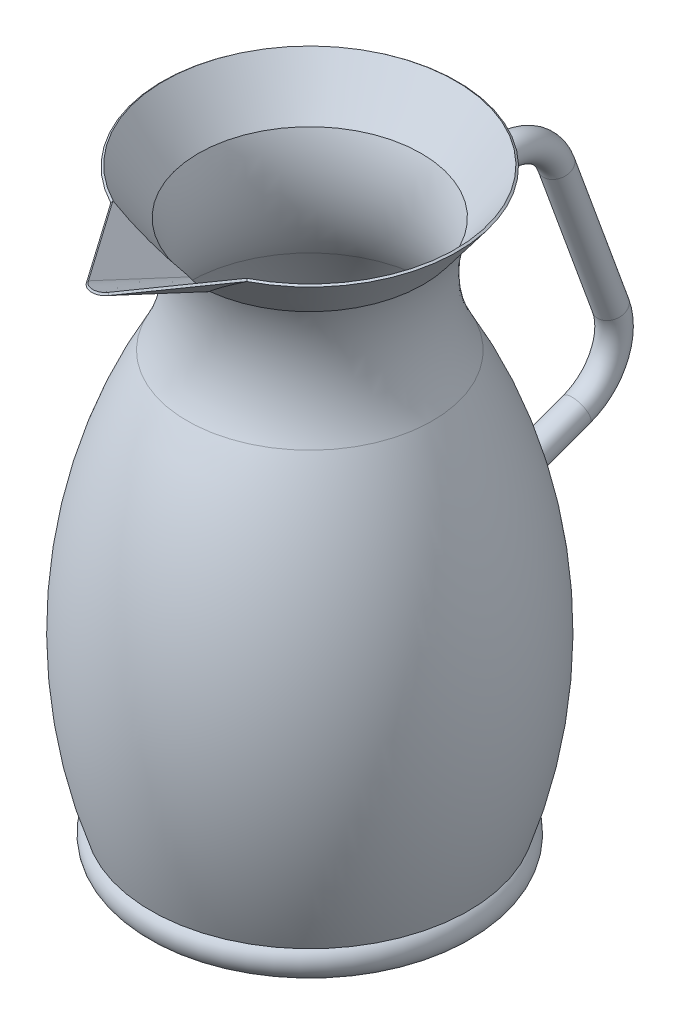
ISO-10303-21;
HEADER;
FILE_DESCRIPTION(('STEP AP214'),'2;1');
FILE_NAME('part.step','',(''),(''),'','','');
FILE_SCHEMA(('AUTOMOTIVE_DESIGN { 1 0 10303 214 1 1 1 1 }'));
ENDSEC;
DATA;
#1=APPLICATION_CONTEXT('core data for automotive mechanical design processes');
#2=APPLICATION_PROTOCOL_DEFINITION('international standard','automotive_design',2000,#1);
#3=PRODUCT_CONTEXT('',#1,'mechanical');
#4=PRODUCT('Part','Part','',(#3));
#5=PRODUCT_RELATED_PRODUCT_CATEGORY('part','',(#4));
#6=PRODUCT_DEFINITION_FORMATION('','',#4);
#7=PRODUCT_DEFINITION_CONTEXT('part definition',#1,'design');
#8=PRODUCT_DEFINITION('design','',#6,#7);
#9=PRODUCT_DEFINITION_SHAPE('','',#8);
#10=(LENGTH_UNIT() NAMED_UNIT(*) SI_UNIT(.MILLI.,.METRE.));
#11=(NAMED_UNIT(*) PLANE_ANGLE_UNIT() SI_UNIT($,.RADIAN.));
#12=(NAMED_UNIT(*) SI_UNIT($,.STERADIAN.) SOLID_ANGLE_UNIT());
#13=UNCERTAINTY_MEASURE_WITH_UNIT(LENGTH_MEASURE(1.E-05),#10,'distance_accuracy_value','');
#14=(GEOMETRIC_REPRESENTATION_CONTEXT(3) GLOBAL_UNCERTAINTY_ASSIGNED_CONTEXT((#13)) GLOBAL_UNIT_ASSIGNED_CONTEXT((#10,
#11,#12)) REPRESENTATION_CONTEXT('',''));
#15=CARTESIAN_POINT('',(0.,0.,0.));
#16=DIRECTION('',(0.,0.,1.));
#17=DIRECTION('',(1.,0.,0.));
#18=AXIS2_PLACEMENT_3D('',#15,#16,#17);
#19=CARTESIAN_POINT('',(23.5194939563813,237.785546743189,16.4685269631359));
#20=DIRECTION('',(-0.516735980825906,0.77593070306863,-0.361822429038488));
#21=DIRECTION('',(0.635605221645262,0.630818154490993,0.445055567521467));
#22=AXIS2_PLACEMENT_3D('',#19,#20,#21);
#23=ELLIPSE('',#22,60.6873266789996,37.3230494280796);
#24=DIRECTION('',(-0.495182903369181,0.671892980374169,-0.550775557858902));
#25=VECTOR('',#24,1.);
#26=SURFACE_OF_LINEAR_EXTRUSION('',#23,#25);
#27=CARTESIAN_POINT('',(29.9487340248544,260.,57.689455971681));
#28=CARTESIAN_POINT('',(29.8850855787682,260.129327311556,57.5970478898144));
#29=CARTESIAN_POINT('',(29.8214476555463,260.258651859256,57.5046286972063));
#30=CARTESIAN_POINT('',(29.6941928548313,260.517295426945,57.3197680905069));
#31=CARTESIAN_POINT('',(29.6305759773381,260.646614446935,57.2273266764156));
#32=CARTESIAN_POINT('',(29.5669696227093,260.775930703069,57.1348741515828));
#33=B_SPLINE_CURVE_WITH_KNOTS('',3,(#27,#28,#29,#30,#31,#32),.UNSPECIFIED.,.F.,.F.,(4,2,4),(0.,
0.513656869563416,1.02731373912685),.UNSPECIFIED.);
#34=CARTESIAN_POINT('',(29.9487340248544,260.,57.689455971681));
#35=VERTEX_POINT('',#34);
#36=CARTESIAN_POINT('',(29.5669696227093,260.775930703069,57.1348741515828));
#37=VERTEX_POINT('',#36);
#38=EDGE_CURVE('E12',#35,#37,#33,.T.);
#39=ORIENTED_EDGE('',*,*,#38,.F.);
#40=CARTESIAN_POINT('',(29.9487340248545,260.,57.689455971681));
#41=CARTESIAN_POINT('',(29.8433588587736,260.100059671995,57.5938416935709));
#42=CARTESIAN_POINT('',(29.7379646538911,260.200089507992,57.4982172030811));
#43=CARTESIAN_POINT('',(29.5271381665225,260.400089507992,57.3069477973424));
#44=CARTESIAN_POINT('',(29.4217058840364,260.500059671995,57.2113028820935));
#45=CARTESIAN_POINT('',(29.3162545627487,260.6,57.115647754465));
#46=B_SPLINE_CURVE_WITH_KNOTS('',3,(#40,#41,#42,#43,#44,#45),.UNSPECIFIED.,.F.,.F.,(4,2,4),(0.,
0.521844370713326,1.04368874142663),.UNSPECIFIED.);
#47=CARTESIAN_POINT('',(29.3162545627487,260.6,57.115647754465));
#48=VERTEX_POINT('',#47);
#49=EDGE_CURVE('E57',#35,#48,#46,.T.);
#50=ORIENTED_EDGE('',*,*,#49,.T.);
#51=EDGE_CURVE('E292',#48,#37,#23,.T.);
#52=ORIENTED_EDGE('',*,*,#51,.T.);
#53=EDGE_LOOP('',(#39,#50,#52));
#54=FACE_BOUND('',#53,.T.);
#55=ADVANCED_FACE('F45',(#54),#26,.F.);
#56=CARTESIAN_POINT('',(0.,260.,0.));
#57=DIRECTION('',(0.,-1.,0.));
#58=DIRECTION('',(0.,0.,-1.));
#59=AXIS2_PLACEMENT_3D('',#56,#57,#58);
#60=CONICAL_SURFACE('',#59,65.,0.927295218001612);
#61=ORIENTED_EDGE('',*,*,#49,.F.);
#62=CARTESIAN_POINT('',(0.,260.,0.));
#63=DIRECTION('',(0.,-1.,0.));
#64=DIRECTION('',(0.,0.,-1.));
#65=AXIS2_PLACEMENT_3D('',#62,#63,#64);
#66=CIRCLE('',#65,65.);
#67=CARTESIAN_POINT('',(-29.9487340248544,260.,57.6894559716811));
#68=VERTEX_POINT('',#67);
#69=EDGE_CURVE('E168',#68,#35,#66,.T.);
#70=ORIENTED_EDGE('',*,*,#69,.F.);
#71=CARTESIAN_POINT('',(-29.9487340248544,260.,57.6894559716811));
#72=CARTESIAN_POINT('',(-29.8433588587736,260.100059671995,57.5938416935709));
#73=CARTESIAN_POINT('',(-29.737964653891,260.200089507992,57.4982172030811));
#74=CARTESIAN_POINT('',(-29.5271381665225,260.400089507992,57.3069477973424));
#75=CARTESIAN_POINT('',(-29.4217058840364,260.500059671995,57.2113028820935));
#76=CARTESIAN_POINT('',(-29.3162545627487,260.6,57.115647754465));
#77=B_SPLINE_CURVE_WITH_KNOTS('',3,(#71,#72,#73,#74,#75,#76),.UNSPECIFIED.,.F.,.F.,(4,2,4),(0.,
0.521844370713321,1.04368874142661),.UNSPECIFIED.);
#78=CARTESIAN_POINT('',(-29.3162545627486,260.6,57.115647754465));
#79=VERTEX_POINT('',#78);
#80=EDGE_CURVE('E323',#68,#79,#77,.T.);
#81=ORIENTED_EDGE('',*,*,#80,.T.);
#82=CARTESIAN_POINT('',(0.,260.6,0.));
#83=DIRECTION('',(0.,1.,0.));
#84=DIRECTION('',(0.,0.,1.));
#85=AXIS2_PLACEMENT_3D('',#82,#83,#84);
#86=CIRCLE('',#85,64.2);
#87=EDGE_CURVE('E206',#79,#48,#86,.F.);
#88=ORIENTED_EDGE('',*,*,#87,.T.);
#89=EDGE_LOOP('',(#61,#70,#81,#88));
#90=FACE_BOUND('',#89,.T.);
#91=ADVANCED_FACE('F304',(#90),#60,.T.);
#92=CARTESIAN_POINT('',(-23.5194939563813,237.785546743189,16.4685269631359));
#93=DIRECTION('',(0.516735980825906,0.77593070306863,-0.361822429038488));
#94=DIRECTION('',(-0.635605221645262,0.630818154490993,0.445055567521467));
#95=AXIS2_PLACEMENT_3D('',#92,#93,#94);
#96=ELLIPSE('',#95,60.6873266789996,37.3230494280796);
#97=DIRECTION('',(0.495182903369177,0.671892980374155,-0.550775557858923));
#98=VECTOR('',#97,1.);
#99=SURFACE_OF_LINEAR_EXTRUSION('',#96,#98);
#100=ORIENTED_EDGE('',*,*,#80,.F.);
#101=CARTESIAN_POINT('',(-29.9487340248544,260.,57.6894559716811));
#102=CARTESIAN_POINT('',(-29.8850855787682,260.129327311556,57.5970478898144));
#103=CARTESIAN_POINT('',(-29.8214476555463,260.258651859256,57.5046286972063));
#104=CARTESIAN_POINT('',(-29.6941928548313,260.517295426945,57.3197680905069));
#105=CARTESIAN_POINT('',(-29.6305759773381,260.646614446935,57.2273266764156));
#106=CARTESIAN_POINT('',(-29.5669696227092,260.775930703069,57.1348741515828));
#107=B_SPLINE_CURVE_WITH_KNOTS('',3,(#101,#102,#103,#104,#105,#106),.UNSPECIFIED.,.F.,.F.,(4,2,
4),(0.,0.513656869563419,1.02731373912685),.UNSPECIFIED.);
#108=CARTESIAN_POINT('',(-29.5669696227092,260.775930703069,57.1348741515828));
#109=VERTEX_POINT('',#108);
#110=EDGE_CURVE('E435',#68,#109,#107,.T.);
#111=ORIENTED_EDGE('',*,*,#110,.T.);
#112=EDGE_CURVE('E289',#109,#79,#96,.T.);
#113=ORIENTED_EDGE('',*,*,#112,.T.);
#114=EDGE_LOOP('',(#100,#111,#113));
#115=FACE_BOUND('',#114,.T.);
#116=ADVANCED_FACE('F298',(#115),#99,.F.);
#117=CARTESIAN_POINT('',(-29.9487340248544,260.,57.6894559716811));
#118=DIRECTION('',(-0.635605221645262,0.630818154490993,0.445055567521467));
#119=DIRECTION('',(0.573576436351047,0.,0.819152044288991));
#120=AXIS2_PLACEMENT_3D('',#117,#118,#119);
#121=PLANE('',#120);
#122=ORIENTED_EDGE('',*,*,#110,.F.);
#123=DIRECTION('',(0.573576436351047,0.,0.819152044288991));
#124=VECTOR('',#123,1.);
#125=CARTESIAN_POINT('',(-29.9487340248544,260.,57.6894559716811));
#126=LINE('',#125,#124);
#127=CARTESIAN_POINT('',(-4.91491226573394,260.,93.4414586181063));
#128=VERTEX_POINT('',#127);
#129=EDGE_CURVE('E127',#68,#128,#126,.T.);
#130=ORIENTED_EDGE('',*,*,#129,.T.);
#131=CARTESIAN_POINT('',(-4.39817628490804,260.775930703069,93.0796361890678));
#132=CARTESIAN_POINT('',(-4.91491226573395,260.,93.4414586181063));
#133=B_SPLINE_CURVE_WITH_KNOTS('',1,(#131,#132),.UNSPECIFIED.,.F.,.F.,(2,2),(0.,1.),.UNSPECIFIED.);
#134=CARTESIAN_POINT('',(-4.39817628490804,260.775930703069,93.0796361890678));
#135=VERTEX_POINT('',#134);
#136=EDGE_CURVE('E441',#128,#135,#133,.F.);
#137=ORIENTED_EDGE('',*,*,#136,.T.);
#138=DIRECTION('',(0.573576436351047,0.,0.819152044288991));
#139=VECTOR('',#138,1.);
#140=CARTESIAN_POINT('',(-29.4319980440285,260.775930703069,57.3276335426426));
#141=LINE('',#140,#139);
#142=EDGE_CURVE('E273',#109,#135,#141,.T.);
#143=ORIENTED_EDGE('',*,*,#142,.F.);
#144=EDGE_LOOP('',(#122,#130,#137,#143));
#145=FACE_BOUND('',#144,.T.);
#146=ADVANCED_FACE('F303',(#145),#121,.T.);
#147=CARTESIAN_POINT('',(-4.39817628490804,260.775930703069,93.0796361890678));
#148=CARTESIAN_POINT('',(-4.18732785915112,260.811211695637,93.4564192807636));
#149=CARTESIAN_POINT('',(-3.92009988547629,260.833255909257,93.8060219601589));
#150=CARTESIAN_POINT('',(-3.29699919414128,260.866380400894,94.4235023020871));
#151=CARTESIAN_POINT('',(-2.94133597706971,260.877159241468,94.6914155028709));
#152=CARTESIAN_POINT('',(-2.16992168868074,260.893121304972,95.12721911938));
#153=CARTESIAN_POINT('',(-1.7541965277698,260.898194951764,95.2951361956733));
#154=CARTESIAN_POINT('',(-0.892303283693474,260.904805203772,95.5202158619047));
#155=CARTESIAN_POINT('',(-0.446158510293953,260.906307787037,95.5773817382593));
#156=CARTESIAN_POINT('',(0.446158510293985,260.906307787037,95.5773817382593));
#157=CARTESIAN_POINT('',(0.892303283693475,260.904805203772,95.5202158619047));
#158=CARTESIAN_POINT('',(1.75419652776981,260.898194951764,95.2951361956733));
#159=CARTESIAN_POINT('',(2.16992168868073,260.893121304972,95.12721911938));
#160=CARTESIAN_POINT('',(2.9413359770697,260.877159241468,94.6914155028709));
#161=CARTESIAN_POINT('',(3.29699919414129,260.866380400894,94.4235023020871));
#162=CARTESIAN_POINT('',(3.9200998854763,260.833255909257,93.8060219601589));
#163=CARTESIAN_POINT('',(4.18732785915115,260.811211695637,93.4564192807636));
#164=CARTESIAN_POINT('',(4.39817628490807,260.775930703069,93.0796361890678));
#165=CARTESIAN_POINT('',(-4.91491226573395,260.,93.4414586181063));
#166=CARTESIAN_POINT('',(-4.63960837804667,260.,93.8346333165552));
#167=CARTESIAN_POINT('',(-4.3169320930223,260.,94.1945755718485));
#168=CARTESIAN_POINT('',(-3.59521768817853,260.,94.8275021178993));
#169=CARTESIAN_POINT('',(-3.19622631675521,260.,95.1004415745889));
#170=CARTESIAN_POINT('',(-2.34475704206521,260.,95.5436884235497));
#171=CARTESIAN_POINT('',(-1.89232607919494,260.,95.7139713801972));
#172=CARTESIAN_POINT('',(-0.959904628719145,260.,95.942133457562));
#173=CARTESIAN_POINT('',(-0.479965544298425,260.,96.));
#174=CARTESIAN_POINT('',(0.479965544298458,260.,96.));
#175=CARTESIAN_POINT('',(0.959904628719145,260.,95.942133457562));
#176=CARTESIAN_POINT('',(1.89232607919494,260.,95.7139713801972));
#177=CARTESIAN_POINT('',(2.3447570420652,260.,95.5436884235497));
#178=CARTESIAN_POINT('',(3.1962263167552,260.,95.1004415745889));
#179=CARTESIAN_POINT('',(3.59521768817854,260.,94.8275021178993));
#180=CARTESIAN_POINT('',(4.3169320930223,260.,94.1945755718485));
#181=CARTESIAN_POINT('',(4.6396083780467,260.,93.8346333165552));
#182=CARTESIAN_POINT('',(4.91491226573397,260.,93.4414586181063));
#183=B_SPLINE_SURFACE_WITH_KNOTS('',1,3,((#147,#148,#149,#150,#151,#152,#153,#154,#155,#156,
#157,#158,#159,#160,#161,#162,#163,#164),(#165,#166,#167,#168,#169,#170,#171,#172,#173,#174,
#175,#176,#177,#178,#179,#180,#181,#182)),.UNSPECIFIED.,.F.,.F.,.F.,(2,2),(4,2,2,2,2,2,2,2,4),
(0.,1.),(5.32325421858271,5.56323699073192,5.80321976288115,6.04320253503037,6.28318530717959,
6.52316807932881,6.76315085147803,7.00313362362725,7.24311639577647),.UNSPECIFIED.);
#184=CARTESIAN_POINT('',(-4.91491226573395,260.,93.4414586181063));
#185=CARTESIAN_POINT('',(-4.63960837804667,260.,93.8346333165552));
#186=CARTESIAN_POINT('',(-4.3169320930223,260.,94.1945755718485));
#187=CARTESIAN_POINT('',(-3.59521768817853,260.,94.8275021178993));
#188=CARTESIAN_POINT('',(-3.19622631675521,260.,95.1004415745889));
#189=CARTESIAN_POINT('',(-2.34475704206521,260.,95.5436884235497));
#190=CARTESIAN_POINT('',(-1.89232607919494,260.,95.7139713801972));
#191=CARTESIAN_POINT('',(-0.959904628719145,260.,95.942133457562));
#192=CARTESIAN_POINT('',(-0.479965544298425,260.,96.));
#193=CARTESIAN_POINT('',(0.479965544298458,260.,96.));
#194=CARTESIAN_POINT('',(0.959904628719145,260.,95.942133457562));
#195=CARTESIAN_POINT('',(1.89232607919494,260.,95.7139713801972));
#196=CARTESIAN_POINT('',(2.3447570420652,260.,95.5436884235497));
#197=CARTESIAN_POINT('',(3.1962263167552,260.,95.1004415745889));
#198=CARTESIAN_POINT('',(3.59521768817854,260.,94.8275021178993));
#199=CARTESIAN_POINT('',(4.3169320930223,260.,94.1945755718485));
#200=CARTESIAN_POINT('',(4.6396083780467,260.,93.8346333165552));
#201=CARTESIAN_POINT('',(4.91491226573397,260.,93.4414586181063));
#202=B_SPLINE_CURVE_WITH_KNOTS('',3,(#184,#185,#186,#187,#188,#189,#190,#191,#192,#193,#194,
#195,#196,#197,#198,#199,#200,#201),.UNSPECIFIED.,.F.,.F.,(4,2,2,2,2,2,2,2,4),(5.32325421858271,
5.56323699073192,5.80321976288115,6.04320253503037,6.28318530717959,6.52316807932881,
6.76315085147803,7.00313362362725,7.24311639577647),.UNSPECIFIED.);
#203=CARTESIAN_POINT('',(4.91491226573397,260.,93.4414586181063));
#204=VERTEX_POINT('',#203);
#205=EDGE_CURVE('E124',#128,#204,#202,.T.);
#206=CARTESIAN_POINT('',(4.91491226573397,260.,93.4414586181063));
#207=CARTESIAN_POINT('',(4.39817628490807,260.775930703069,93.0796361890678));
#208=B_SPLINE_CURVE_WITH_KNOTS('',1,(#206,#207),.UNSPECIFIED.,.F.,.F.,(2,2),(0.,1.),.UNSPECIFIED.);
#209=CARTESIAN_POINT('',(4.39817628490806,260.775930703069,93.0796361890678));
#210=VERTEX_POINT('',#209);
#211=EDGE_CURVE('E445',#204,#210,#208,.T.);
#212=CARTESIAN_POINT('',(-4.39817628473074,260.775930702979,93.0796361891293));
#213=CARTESIAN_POINT('',(-4.37180195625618,260.780343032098,93.126768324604));
#214=CARTESIAN_POINT('',(-4.34457226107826,260.784535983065,93.1734412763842));
#215=CARTESIAN_POINT('',(-4.28840245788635,260.792532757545,93.2658947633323));
#216=CARTESIAN_POINT('',(-4.25945939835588,260.796335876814,93.3116735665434));
#217=CARTESIAN_POINT('',(-4.19990480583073,260.80359363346,93.4022766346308));
#218=CARTESIAN_POINT('',(-4.16929042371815,260.807047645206,93.4470990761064));
#219=CARTESIAN_POINT('',(-4.10643837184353,260.813642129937,93.5357315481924));
#220=CARTESIAN_POINT('',(-4.07419798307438,260.816782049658,93.5795396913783));
#221=CARTESIAN_POINT('',(-4.00814102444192,260.822779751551,93.6660881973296));
#222=CARTESIAN_POINT('',(-3.97432188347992,260.825637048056,93.7088266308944));
#223=CARTESIAN_POINT('',(-3.90515623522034,260.83109729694,93.793183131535));
#224=CARTESIAN_POINT('',(-3.86980731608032,260.833699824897,93.8347992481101));
#225=CARTESIAN_POINT('',(-3.79763225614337,260.838675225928,93.9168610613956));
#226=CARTESIAN_POINT('',(-3.76080386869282,260.841047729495,93.957304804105));
#227=CARTESIAN_POINT('',(-3.68572111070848,260.8455849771,94.0369742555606));
#228=CARTESIAN_POINT('',(-3.64746466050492,260.84774940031,94.0761980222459));
#229=CARTESIAN_POINT('',(-3.5695779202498,260.851889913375,94.1533822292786));
#230=CARTESIAN_POINT('',(-3.52994571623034,260.853865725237,94.1913407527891));
#231=CARTESIAN_POINT('',(-3.44936037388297,260.857646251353,94.265951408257));
#232=CARTESIAN_POINT('',(-3.40840548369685,260.859450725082,94.3026016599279));
#233=CARTESIAN_POINT('',(-3.32522832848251,260.862903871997,94.3745548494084));
#234=CARTESIAN_POINT('',(-3.2830044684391,260.86455233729,94.4098559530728));
#235=CARTESIAN_POINT('',(-3.1973435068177,260.867707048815,94.4790719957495));
#236=CARTESIAN_POINT('',(-3.15390496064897,260.869213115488,94.5129851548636));
#237=CARTESIAN_POINT('',(-3.06586927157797,260.872095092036,94.5793884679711));
#238=CARTESIAN_POINT('',(-3.02127082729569,260.873470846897,94.6118769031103));
#239=CARTESIAN_POINT('',(-2.93097045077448,260.876102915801,94.6753958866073));
#240=CARTESIAN_POINT('',(-2.88526735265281,260.877359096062,94.7064247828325));
#241=CARTESIAN_POINT('',(-2.79281320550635,260.879761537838,94.7669917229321));
#242=CARTESIAN_POINT('',(-2.74606111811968,260.880907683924,94.7965281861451));
#243=CARTESIAN_POINT('',(-2.65156492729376,260.883098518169,94.8540791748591));
#244=CARTESIAN_POINT('',(-2.60381990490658,260.884143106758,94.8820921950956));
#245=CARTESIAN_POINT('',(-2.50739415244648,260.886138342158,94.9365670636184));
#246=CARTESIAN_POINT('',(-2.45871261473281,260.887088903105,94.9630274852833));
#247=CARTESIAN_POINT('',(-2.36047049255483,260.888902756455,95.0143697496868));
#248=CARTESIAN_POINT('',(-2.31090920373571,260.889765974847,95.0392502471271));
#249=CARTESIAN_POINT('',(-2.21096457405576,260.891411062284,95.0874070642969));
#250=CARTESIAN_POINT('',(-2.16058062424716,260.892192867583,95.1106821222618));
#251=CARTESIAN_POINT('',(-2.05904798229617,260.893680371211,95.1556042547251));
#252=CARTESIAN_POINT('',(-2.0078987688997,260.8943860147,95.177250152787));
#253=CARTESIAN_POINT('',(-1.90489320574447,260.895725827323,95.2188919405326));
#254=CARTESIAN_POINT('',(-1.8530364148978,260.896359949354,95.2388867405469));
#255=CARTESIAN_POINT('',(-1.74867358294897,260.897560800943,95.2772060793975));
#256=CARTESIAN_POINT('',(-1.69616717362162,260.898127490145,95.2955296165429));
#257=CARTESIAN_POINT('',(-1.59056325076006,260.899197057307,95.3304879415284));
#258=CARTESIAN_POINT('',(-1.53746543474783,260.899699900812,95.3471218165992));
#259=CARTESIAN_POINT('',(-1.43073708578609,260.9006449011,95.3786840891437));
#260=CARTESIAN_POINT('',(-1.37710630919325,260.901087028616,95.3936116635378));
#261=CARTESIAN_POINT('',(-1.26937064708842,260.901913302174,95.4217463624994));
#262=CARTESIAN_POINT('',(-1.21526557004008,260.902297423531,95.434952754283));
#263=CARTESIAN_POINT('',(-1.10664011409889,260.903010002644,95.4596318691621));
#264=CARTESIAN_POINT('',(-1.05211958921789,260.903338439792,95.4711039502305));
#265=CARTESIAN_POINT('',(-0.942722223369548,260.90394160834,95.4923029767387));
#266=CARTESIAN_POINT('',(-0.887845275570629,260.90421632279,95.5020293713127));
#267=CARTESIAN_POINT('',(-0.777794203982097,260.904713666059,95.5197273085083));
#268=CARTESIAN_POINT('',(-0.722620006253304,260.904936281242,95.5276983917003));
#269=CARTESIAN_POINT('',(-0.61203370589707,260.905330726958,95.5418777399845));
#270=CARTESIAN_POINT('',(-0.556621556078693,260.905502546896,95.5480856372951));
#271=CARTESIAN_POINT('',(-0.445618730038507,260.905796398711,95.5587323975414));
#272=CARTESIAN_POINT('',(-0.390028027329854,260.905918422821,95.5631709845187));
#273=CARTESIAN_POINT('',(-0.278727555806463,260.906113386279,95.5702746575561));
#274=CARTESIAN_POINT('',(-0.223017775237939,260.906186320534,95.5729395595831));
#275=CARTESIAN_POINT('',(-0.111538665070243,260.906283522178,95.576493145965));
#276=CARTESIAN_POINT('',(-0.0557693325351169,260.906307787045,95.5773817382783));
#277=CARTESIAN_POINT('',(0.0557693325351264,260.906307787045,95.5773817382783));
#278=CARTESIAN_POINT('',(0.111538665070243,260.906283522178,95.576493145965));
#279=CARTESIAN_POINT('',(0.223017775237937,260.906186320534,95.5729395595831));
#280=CARTESIAN_POINT('',(0.278727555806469,260.906113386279,95.5702746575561));
#281=CARTESIAN_POINT('',(0.390028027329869,260.905918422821,95.5631709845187));
#282=CARTESIAN_POINT('',(0.445618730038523,260.905796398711,95.5587323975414));
#283=CARTESIAN_POINT('',(0.556621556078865,260.905502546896,95.5480856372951));
#284=CARTESIAN_POINT('',(0.612033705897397,260.905330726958,95.5418777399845));
#285=CARTESIAN_POINT('',(0.722620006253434,260.904936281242,95.5276983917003));
#286=CARTESIAN_POINT('',(0.777794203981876,260.904713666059,95.5197273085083));
#287=CARTESIAN_POINT('',(0.887845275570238,260.90421632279,95.5020293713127));
#288=CARTESIAN_POINT('',(0.942722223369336,260.90394160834,95.4923029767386));
#289=CARTESIAN_POINT('',(1.05211958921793,260.903338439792,95.4711039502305));
#290=CARTESIAN_POINT('',(1.10664011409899,260.903010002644,95.4596318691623));
#291=CARTESIAN_POINT('',(1.21526557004,260.902297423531,95.4349527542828));
#292=CARTESIAN_POINT('',(1.26937064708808,260.901913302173,95.4217463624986));
#293=CARTESIAN_POINT('',(1.37710630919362,260.901087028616,95.3936116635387));
#294=CARTESIAN_POINT('',(1.43073708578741,260.900644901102,95.3786840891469));
#295=CARTESIAN_POINT('',(1.53746543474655,260.89969990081,95.3471218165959));
#296=CARTESIAN_POINT('',(1.59056325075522,260.8991970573,95.3304879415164));
#297=CARTESIAN_POINT('',(1.69616717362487,260.898127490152,95.2955296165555));
#298=CARTESIAN_POINT('',(1.74867358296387,260.897560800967,95.2772060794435));
#299=CARTESIAN_POINT('',(1.85303641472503,260.89635994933,95.2388867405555));
#300=CARTESIAN_POINT('',(1.90489320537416,260.895725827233,95.2188919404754));
#301=CARTESIAN_POINT('',(2.00789876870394,260.894386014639,95.177250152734));
#302=CARTESIAN_POINT('',(2.05904798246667,260.893680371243,95.1556042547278));
#303=CARTESIAN_POINT('',(2.1605806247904,260.892192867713,95.1106821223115));
#304=CARTESIAN_POINT('',(2.21096457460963,260.89141106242,95.0874070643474));
#305=CARTESIAN_POINT('',(2.31090920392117,260.889765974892,95.0392502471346));
#306=CARTESIAN_POINT('',(2.3604704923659,260.888902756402,95.0143697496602));
#307=CARTESIAN_POINT('',(2.45871261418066,260.887088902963,94.9630274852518));
#308=CARTESIAN_POINT('',(2.50739415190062,260.886138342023,94.9365670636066));
#309=CARTESIAN_POINT('',(2.60381990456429,260.884143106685,94.8820921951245));
#310=CARTESIAN_POINT('',(2.65156492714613,260.883098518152,94.8540791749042));
#311=CARTESIAN_POINT('',(2.74606111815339,260.880907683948,94.7965281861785));
#312=CARTESIAN_POINT('',(2.79281320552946,260.879761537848,94.7669917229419));
#313=CARTESIAN_POINT('',(2.88526735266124,260.87735909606,94.7064247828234));
#314=CARTESIAN_POINT('',(2.93097045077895,260.876102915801,94.6753958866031));
#315=CARTESIAN_POINT('',(3.0212708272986,260.873470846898,94.6118769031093));
#316=CARTESIAN_POINT('',(3.06586927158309,260.872095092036,94.579388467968));
#317=CARTESIAN_POINT('',(3.15390496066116,260.869213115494,94.5129851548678));
#318=CARTESIAN_POINT('',(3.19734350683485,260.867707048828,94.4790719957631));
#319=CARTESIAN_POINT('',(3.28300446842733,260.864552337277,94.4098559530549));
#320=CARTESIAN_POINT('',(3.32522832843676,260.862903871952,94.3745548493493));
#321=CARTESIAN_POINT('',(3.40840548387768,260.859450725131,94.3026016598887));
#322=CARTESIAN_POINT('',(3.44936037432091,260.857646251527,94.2659514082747));
#323=CARTESIAN_POINT('',(3.52994571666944,260.853865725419,94.1913407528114));
#324=CARTESIAN_POINT('',(3.56957792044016,260.851889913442,94.1533822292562));
#325=CARTESIAN_POINT('',(3.64746466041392,260.847749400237,94.0761980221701));
#326=CARTESIAN_POINT('',(3.68572111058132,260.845584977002,94.0369742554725));
#327=CARTESIAN_POINT('',(3.76080386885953,260.841047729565,93.9573048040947));
#328=CARTESIAN_POINT('',(3.79763225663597,260.83867522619,93.9168610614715));
#329=CARTESIAN_POINT('',(3.86980731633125,260.833699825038,93.834799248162));
#330=CARTESIAN_POINT('',(3.90515623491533,260.831097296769,93.7931831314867));
#331=CARTESIAN_POINT('',(3.9743218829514,260.825637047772,93.7088266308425));
#332=CARTESIAN_POINT('',(4.00814102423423,260.822779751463,93.6660881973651));
#333=CARTESIAN_POINT('',(4.07419798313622,260.816782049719,93.5795396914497));
#334=CARTESIAN_POINT('',(4.10643837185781,260.813642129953,93.5357315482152));
#335=CARTESIAN_POINT('',(4.16929042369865,260.80704764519,93.4470990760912));
#336=CARTESIAN_POINT('',(4.19990480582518,260.803593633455,93.4022766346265));
#337=CARTESIAN_POINT('',(4.25945939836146,260.796335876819,93.3116735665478));
#338=CARTESIAN_POINT('',(4.28840245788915,260.792532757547,93.2658947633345));
#339=CARTESIAN_POINT('',(4.34457226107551,260.784535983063,93.173441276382));
#340=CARTESIAN_POINT('',(4.37180195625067,260.780343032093,93.1267683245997));
#341=CARTESIAN_POINT('',(4.39817628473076,260.775930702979,93.0796361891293));
#342=B_SPLINE_CURVE_WITH_KNOTS('',3,(#212,#213,#214,#215,#216,#217,#218,#219,#220,#221,#222,
#223,#224,#225,#226,#227,#228,#229,#230,#231,#232,#233,#234,#235,#236,#237,#238,#239,#240,#241,
#242,#243,#244,#245,#246,#247,#248,#249,#250,#251,#252,#253,#254,#255,#256,#257,#258,#259,#260,
#261,#262,#263,#264,#265,#266,#267,#268,#269,#270,#271,#272,#273,#274,#275,#276,#277,#278,#279,
#280,#281,#282,#283,#284,#285,#286,#287,#288,#289,#290,#291,#292,#293,#294,#295,#296,#297,#298,
#299,#300,#301,#302,#303,#304,#305,#306,#307,#308,#309,#310,#311,#312,#313,#314,#315,#316,#317,
#318,#319,#320,#321,#322,#323,#324,#325,#326,#327,#328,#329,#330,#331,#332,#333,#334,#335,#336,
#337,#338,#339,#340,#341),.UNSPECIFIED.,.F.,.F.,(4,2,2,2,2,2,2,2,2,2,2,2,2,2,2,2,2,2,2,2,2,2,2,
2,2,2,2,2,2,2,2,2,2,2,2,2,2,2,2,2,2,2,2,2,2,2,2,2,2,2,2,2,2,2,2,2,2,2,2,2,2,2,2,2,4),(0.,
0.162558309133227,0.325405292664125,0.48853912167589,0.651955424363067,0.815647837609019,
0.979608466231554,1.1438282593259,1.30829732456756,1.47300517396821,1.63794092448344,
1.80309345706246,1.96845153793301,2.13400391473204,2.29973938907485,2.46564686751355,
2.63171540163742,2.7979342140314,2.96429271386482,3.13078050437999,3.29738738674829,
3.46410335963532,3.63091860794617,3.79782349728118,3.96480856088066,4.13186448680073,
4.29898210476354,4.46615236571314,4.63336632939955,4.8006151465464,4.96789003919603,
5.13518228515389,5.30248319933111,5.46978411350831,5.6370763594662,5.80435125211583,
5.97160006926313,6.13881403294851,6.30598429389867,6.47310191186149,6.64015783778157,
6.80714290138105,6.97404779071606,7.14086303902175,7.30757901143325,7.47418589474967,
7.64067368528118,7.80703218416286,7.97325099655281,8.13931953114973,8.30522700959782,
8.47096248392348,8.6365148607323,8.80187294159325,8.96702547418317,9.13196122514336,
9.29666907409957,9.46113813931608,9.62535793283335,9.78931856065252,9.95301097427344,
10.1164272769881,10.2795611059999,10.4424080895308,10.604966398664),.UNSPECIFIED.);
#343=EDGE_CURVE('E196',#135,#210,#342,.T.);
#344=ORIENTED_EDGE('',*,*,#136,.F.);
#345=ORIENTED_EDGE('',*,*,#205,.T.);
#346=ORIENTED_EDGE('',*,*,#211,.T.);
#347=ORIENTED_EDGE('',*,*,#343,.F.);
#348=EDGE_LOOP('',(#344,#345,#346,#347));
#349=FACE_BOUND('',#348,.T.);
#350=ADVANCED_FACE('F406',(#349),#183,.T.);
#351=CARTESIAN_POINT('',(4.91491226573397,260.,93.4414586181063));
#352=DIRECTION('',(0.635605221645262,0.630818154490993,0.445055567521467));
#353=DIRECTION('',(0.573576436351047,0.,-0.819152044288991));
#354=AXIS2_PLACEMENT_3D('',#351,#352,#353);
#355=PLANE('',#354);
#356=DIRECTION('',(0.573576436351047,0.,-0.819152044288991));
#357=VECTOR('',#356,1.);
#358=CARTESIAN_POINT('',(4.91491226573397,260.,93.4414586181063));
#359=LINE('',#358,#357);
#360=EDGE_CURVE('E185',#204,#35,#359,.T.);
#361=ORIENTED_EDGE('',*,*,#360,.T.);
#362=ORIENTED_EDGE('',*,*,#38,.T.);
#363=DIRECTION('',(0.573576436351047,0.,-0.819152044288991));
#364=VECTOR('',#363,1.);
#365=CARTESIAN_POINT('',(4.39817628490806,260.775930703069,93.0796361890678));
#366=LINE('',#365,#364);
#367=EDGE_CURVE('E285',#210,#37,#366,.T.);
#368=ORIENTED_EDGE('',*,*,#367,.F.);
#369=ORIENTED_EDGE('',*,*,#211,.F.);
#370=EDGE_LOOP('',(#361,#362,#368,#369));
#371=FACE_BOUND('',#370,.T.);
#372=ADVANCED_FACE('F47',(#371),#355,.T.);
#373=CARTESIAN_POINT('',(0.,260.,90.));
#374=DIRECTION('',(0.,1.,0.));
#375=DIRECTION('',(0.,0.,1.));
#376=AXIS2_PLACEMENT_3D('',#373,#374,#375);
#377=CIRCLE('',#376,6.00000000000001);
#378=DIRECTION('',(0.,-0.422618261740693,-0.906307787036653));
#379=VECTOR('',#378,1.);
#380=SURFACE_OF_LINEAR_EXTRUSION('',#377,#379);
#381=OFFSET_SURFACE('',#380,1.,.F.);
#382=CARTESIAN_POINT('',(-4.39817628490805,240.119475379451,48.781724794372));
#383=CARTESIAN_POINT('',(-4.36563978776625,240.095057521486,48.7758202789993));
#384=CARTESIAN_POINT('',(-4.33259452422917,240.071268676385,48.7701752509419));
#385=CARTESIAN_POINT('',(-4.26561429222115,240.024883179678,48.7593587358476));
#386=CARTESIAN_POINT('',(-4.23167956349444,240.002286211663,48.7541871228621));
#387=CARTESIAN_POINT('',(-4.12881371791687,239.936234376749,48.7393253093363));
#388=CARTESIAN_POINT('',(-4.05871842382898,239.894442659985,48.7302699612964));
#389=CARTESIAN_POINT('',(-3.91669746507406,239.815155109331,48.7136272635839));
#390=CARTESIAN_POINT('',(-3.84478965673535,239.777629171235,48.7060293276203));
#391=CARTESIAN_POINT('',(-3.69908781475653,239.706115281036,48.6919867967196));
#392=CARTESIAN_POINT('',(-3.62529278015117,239.672129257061,48.685542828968));
#393=CARTESIAN_POINT('',(-3.42283029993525,239.584208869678,48.6693572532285));
#394=CARTESIAN_POINT('',(-3.29271709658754,239.533421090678,48.6605594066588));
#395=CARTESIAN_POINT('',(-3.02936840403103,239.440089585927,48.6451085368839));
#396=CARTESIAN_POINT('',(-2.89613036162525,239.397552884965,48.6384573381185));
#397=CARTESIAN_POINT('',(-2.62742188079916,239.319819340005,48.6268040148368));
#398=CARTESIAN_POINT('',(-2.49195057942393,239.284625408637,48.6218025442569));
#399=CARTESIAN_POINT('',(-2.14935012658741,239.204483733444,48.6108310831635));
#400=CARTESIAN_POINT('',(-1.94118934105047,239.163824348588,48.6056852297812));
#401=CARTESIAN_POINT('',(-1.52260323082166,239.095990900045,48.5974398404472));
#402=CARTESIAN_POINT('',(-1.31217702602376,239.068822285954,48.5943411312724));
#403=CARTESIAN_POINT('',(-0.947640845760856,239.032671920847,48.5903201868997));
#404=CARTESIAN_POINT('',(-0.793817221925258,239.020751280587,48.5890349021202));
#405=CARTESIAN_POINT('',(-0.485803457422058,239.003288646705,48.5871707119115));
#406=CARTESIAN_POINT('',(-0.331613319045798,238.99774661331,48.5865918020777));
#407=CARTESIAN_POINT('',(-0.0230039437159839,238.992932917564,48.5860882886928));
#408=CARTESIAN_POINT('',(0.131415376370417,238.993666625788,48.5861642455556));
#409=CARTESIAN_POINT('',(0.440102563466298,239.001431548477,48.5869787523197));
#410=CARTESIAN_POINT('',(0.594370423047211,239.008463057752,48.5877173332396));
#411=CARTESIAN_POINT('',(0.90203523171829,239.028928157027,48.5899190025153));
#412=CARTESIAN_POINT('',(1.05543340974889,239.042343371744,48.5913800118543));
#413=CARTESIAN_POINT('',(1.36148890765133,239.0758278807,48.5951530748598));
#414=CARTESIAN_POINT('',(1.51414626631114,239.095896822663,48.5974650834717));
#415=CARTESIAN_POINT('',(1.8181799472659,239.143068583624,48.6031386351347));
#416=CARTESIAN_POINT('',(1.96955753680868,239.17016331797,48.6064989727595));
#417=CARTESIAN_POINT('',(2.27069106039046,239.231972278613,48.614562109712));
#418=CARTESIAN_POINT('',(2.42044738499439,239.266684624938,48.619264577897));
#419=CARTESIAN_POINT('',(2.70653782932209,239.341615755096,48.6300095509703));
#420=CARTESIAN_POINT('',(2.84303527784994,239.381225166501,48.635924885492));
#421=CARTESIAN_POINT('',(3.1134083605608,239.468542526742,48.6497222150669));
#422=CARTESIAN_POINT('',(3.24728291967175,239.516253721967,48.6576049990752));
#423=CARTESIAN_POINT('',(3.51037288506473,239.620580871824,48.6759119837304));
#424=CARTESIAN_POINT('',(3.63961264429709,239.677137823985,48.6863195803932));
#425=CARTESIAN_POINT('',(3.89251847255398,239.800850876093,48.7105673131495));
#426=CARTESIAN_POINT('',(4.01619177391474,239.867992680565,48.724402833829));
#427=CARTESIAN_POINT('',(4.18071562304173,239.969191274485,48.7467024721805));
#428=CARTESIAN_POINT('',(4.22519768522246,239.997824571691,48.753148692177));
#429=CARTESIAN_POINT('',(4.31279678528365,240.057107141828,48.7668248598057));
#430=CARTESIAN_POINT('',(4.35591104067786,240.087760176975,48.7740562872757));
#431=CARTESIAN_POINT('',(4.39817628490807,240.119475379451,48.781724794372));
#432=B_SPLINE_CURVE_WITH_KNOTS('',3,(#382,#383,#384,#385,#386,#387,#388,#389,#390,#391,#392,
#393,#394,#395,#396,#397,#398,#399,#400,#401,#402,#403,#404,#405,#406,#407,#408,#409,#410,#411,
#412,#413,#414,#415,#416,#417,#418,#419,#420,#421,#422,#423,#424,#425,#426,#427,#428,#429,#430,
#431),.UNSPECIFIED.,.F.,.F.,(4,2,2,2,2,2,2,2,2,2,2,2,2,2,2,2,2,2,2,2,2,2,2,2,4),(0.,
0.123296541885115,0.246560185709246,0.492701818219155,0.736981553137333,0.981393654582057,
1.40085975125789,1.82068141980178,2.2406693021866,2.87659011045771,3.51276759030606,
3.97550975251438,4.43824902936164,4.90138434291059,5.36454133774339,5.82637314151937,
6.28818049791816,6.74945878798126,7.21062336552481,7.63715185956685,8.06385166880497,
8.48781800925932,8.91121658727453,9.07104078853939,9.23117160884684),.UNSPECIFIED.);
#433=CARTESIAN_POINT('',(-4.39817628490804,240.119475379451,48.781724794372));
#434=VERTEX_POINT('',#433);
#435=CARTESIAN_POINT('',(4.39817628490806,240.119475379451,48.781724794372));
#436=VERTEX_POINT('',#435);
#437=EDGE_CURVE('E226',#434,#436,#432,.T.);
#438=ORIENTED_EDGE('',*,*,#437,.F.);
#439=DIRECTION('',(0.,-0.422618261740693,-0.906307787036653));
#440=VECTOR('',#439,1.);
#441=CARTESIAN_POINT('',(-4.39817628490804,260.775930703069,93.0796361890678));
#442=LINE('',#441,#440);
#443=EDGE_CURVE('E197',#135,#434,#442,.T.);
#444=ORIENTED_EDGE('',*,*,#443,.F.);
#445=ORIENTED_EDGE('',*,*,#343,.T.);
#446=DIRECTION('',(0.,-0.422618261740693,-0.906307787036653));
#447=VECTOR('',#446,1.);
#448=CARTESIAN_POINT('',(4.39817628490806,260.775930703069,93.0796361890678));
#449=LINE('',#448,#447);
#450=EDGE_CURVE('E281',#210,#436,#449,.T.);
#451=ORIENTED_EDGE('',*,*,#450,.T.);
#452=EDGE_LOOP('',(#438,#444,#445,#451));
#453=FACE_BOUND('',#452,.T.);
#454=ADVANCED_FACE('F208',(#453),#381,.T.);
#455=CARTESIAN_POINT('',(4.39817628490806,260.775930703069,93.0796361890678));
#456=DIRECTION('',(-0.516735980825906,0.77593070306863,-0.361822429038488));
#457=DIRECTION('',(-0.832323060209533,-0.554290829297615,0.));
#458=AXIS2_PLACEMENT_3D('',#455,#456,#457);
#459=PLANE('',#458);
#460=CARTESIAN_POINT('',(23.5194939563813,237.785546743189,16.4685269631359));
#461=DIRECTION('',(-0.516735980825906,0.77593070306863,-0.361822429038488));
#462=DIRECTION('',(0.635605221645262,0.630818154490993,0.445055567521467));
#463=AXIS2_PLACEMENT_3D('',#460,#461,#462);
#464=ELLIPSE('',#463,60.6873266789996,37.3230494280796);
#465=CARTESIAN_POINT('',(4.88216267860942,240.482196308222,48.8683781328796));
#466=VERTEX_POINT('',#465);
#467=EDGE_CURVE('E234',#466,#48,#464,.T.);
#468=ORIENTED_EDGE('',*,*,#467,.F.);
#469=CARTESIAN_POINT('',(4.39817628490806,240.119475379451,48.781724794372));
#470=CARTESIAN_POINT('',(4.47877433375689,240.179972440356,48.7963552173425));
#471=CARTESIAN_POINT('',(4.55940555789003,240.240447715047,48.8108915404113));
#472=CARTESIAN_POINT('',(4.72073435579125,240.361354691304,48.8397759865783));
#473=CARTESIAN_POINT('',(4.80143192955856,240.421786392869,48.8541241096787));
#474=CARTESIAN_POINT('',(4.88216267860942,240.482196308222,48.8683781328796));
#475=B_SPLINE_CURVE_WITH_KNOTS('',3,(#469,#470,#471,#472,#473,#474),.UNSPECIFIED.,.F.,.F.,(4,2,
4),(0.,0.30549896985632,0.610997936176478),.UNSPECIFIED.);
#476=EDGE_CURVE('E232',#436,#466,#475,.T.);
#477=ORIENTED_EDGE('',*,*,#476,.F.);
#478=ORIENTED_EDGE('',*,*,#450,.F.);
#479=ORIENTED_EDGE('',*,*,#367,.T.);
#480=ORIENTED_EDGE('',*,*,#51,.F.);
#481=EDGE_LOOP('',(#468,#477,#478,#479,#480));
#482=FACE_BOUND('',#481,.T.);
#483=ADVANCED_FACE('F218',(#482),#459,.T.);
#484=CARTESIAN_POINT('',(-29.4319980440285,260.775930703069,57.3276335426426));
#485=DIRECTION('',(0.516735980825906,0.77593070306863,-0.361822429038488));
#486=DIRECTION('',(-0.832323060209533,0.554290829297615,0.));
#487=AXIS2_PLACEMENT_3D('',#484,#485,#486);
#488=PLANE('',#487);
#489=CARTESIAN_POINT('',(-23.5194939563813,237.785546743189,16.4685269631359));
#490=DIRECTION('',(0.516735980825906,0.77593070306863,-0.361822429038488));
#491=DIRECTION('',(-0.635605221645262,0.630818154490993,0.445055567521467));
#492=AXIS2_PLACEMENT_3D('',#489,#490,#491);
#493=ELLIPSE('',#492,60.6873266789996,37.3230494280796);
#494=CARTESIAN_POINT('',(-4.88216267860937,240.482196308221,48.8683781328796));
#495=VERTEX_POINT('',#494);
#496=EDGE_CURVE('E237',#79,#495,#493,.T.);
#497=ORIENTED_EDGE('',*,*,#496,.F.);
#498=ORIENTED_EDGE('',*,*,#112,.F.);
#499=ORIENTED_EDGE('',*,*,#142,.T.);
#500=ORIENTED_EDGE('',*,*,#443,.T.);
#501=CARTESIAN_POINT('',(-4.88216267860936,240.482196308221,48.8683781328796));
#502=CARTESIAN_POINT('',(-4.80143192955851,240.421786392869,48.8541241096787));
#503=CARTESIAN_POINT('',(-4.72073435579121,240.361354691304,48.8397759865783));
#504=CARTESIAN_POINT('',(-4.55940555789,240.240447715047,48.8108915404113));
#505=CARTESIAN_POINT('',(-4.47877433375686,240.179972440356,48.7963552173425));
#506=CARTESIAN_POINT('',(-4.39817628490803,240.119475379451,48.781724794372));
#507=B_SPLINE_CURVE_WITH_KNOTS('',3,(#501,#502,#503,#504,#505,#506),.UNSPECIFIED.,.F.,.F.,(4,2,
4),(0.,0.305498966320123,0.61099793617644),.UNSPECIFIED.);
#508=EDGE_CURVE('E238',#495,#434,#507,.T.);
#509=ORIENTED_EDGE('',*,*,#508,.F.);
#510=EDGE_LOOP('',(#497,#498,#499,#500,#509));
#511=FACE_BOUND('',#510,.T.);
#512=ADVANCED_FACE('F249',(#511),#488,.T.);
#513=CARTESIAN_POINT('',(0.,240.6,0.));
#514=DIRECTION('',(0.,1.,0.));
#515=DIRECTION('',(0.,0.,1.));
#516=AXIS2_PLACEMENT_3D('',#513,#514,#515);
#517=CONICAL_SURFACE('',#516,49.2,0.643501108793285);
#518=CARTESIAN_POINT('',(0.,240.482196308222,0.));
#519=DIRECTION('',(0.,-1.,0.));
#520=DIRECTION('',(0.,0.,-1.));
#521=AXIS2_PLACEMENT_3D('',#518,#519,#520);
#522=CIRCLE('',#521,49.1116472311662);
#523=EDGE_CURVE('E244',#495,#466,#522,.T.);
#524=ORIENTED_EDGE('',*,*,#523,.T.);
#525=ORIENTED_EDGE('',*,*,#467,.T.);
#526=ORIENTED_EDGE('',*,*,#87,.F.);
#527=ORIENTED_EDGE('',*,*,#496,.T.);
#528=EDGE_LOOP('',(#524,#525,#526,#527));
#529=FACE_BOUND('',#528,.T.);
#530=ADVANCED_FACE('F254',(#529),#517,.F.);
#531=CARTESIAN_POINT('',(0.,219.364292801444,0.));
#532=DIRECTION('',(0.,-1.,0.));
#533=DIRECTION('',(0.,0.,-1.));
#534=AXIS2_PLACEMENT_3D('',#531,#532,#533);
#535=TOROIDAL_SURFACE('',#534,106.553660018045,61.2009042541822);
#536=CARTESIAN_POINT('',(0.,189.512228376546,0.));
#537=DIRECTION('',(0.,-1.,0.));
#538=DIRECTION('',(0.,0.,-1.));
#539=AXIS2_PLACEMENT_3D('',#536,#537,#538);
#540=CIRCLE('',#539,53.1270287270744);
#541=CARTESIAN_POINT('',(0.,189.512228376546,-53.1270287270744));
#542=VERTEX_POINT('',#541);
#543=EDGE_CURVE('E263',#542,#542,#540,.T.);
#544=ORIENTED_EDGE('',*,*,#543,.T.);
#545=EDGE_LOOP('',(#544));
#546=FACE_BOUND('',#545,.T.);
#547=ORIENTED_EDGE('',*,*,#437,.T.);
#548=ORIENTED_EDGE('',*,*,#476,.T.);
#549=ORIENTED_EDGE('',*,*,#523,.F.);
#550=ORIENTED_EDGE('',*,*,#508,.T.);
#551=EDGE_LOOP('',(#547,#548,#549,#550));
#552=FACE_BOUND('',#551,.T.);
#553=ADVANCED_FACE('F221',(#546,#552),#535,.T.);
#554=CARTESIAN_POINT('',(0.,-166.460205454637,0.));
#555=DIRECTION('',(0.,-1.,0.));
#556=DIRECTION('',(0.,0.,1.));
#557=AXIS2_PLACEMENT_3D('',#554,#555,#556);
#558=SPHERICAL_SURFACE('',#557,176.);
#559=CARTESIAN_POINT('',(0.,1.,0.));
#560=DIRECTION('',(0.,-1.,0.));
#561=DIRECTION('',(0.,0.,-1.));
#562=AXIS2_PLACEMENT_3D('',#559,#560,#561);
#563=CIRCLE('',#562,54.1579134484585);
#564=CARTESIAN_POINT('',(0.,1.,-54.1579134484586));
#565=VERTEX_POINT('',#564);
#566=EDGE_CURVE('E204',#565,#565,#563,.T.);
#567=ORIENTED_EDGE('',*,*,#566,.F.);
#568=EDGE_LOOP('',(#567));
#569=FACE_BOUND('',#568,.T.);
#570=ADVANCED_FACE('F492',(#569),#558,.T.);
#571=CARTESIAN_POINT('',(0.,1.,-54.));
#572=DIRECTION('',(0.,-1.,0.));
#573=DIRECTION('',(0.,0.,-1.));
#574=AXIS2_PLACEMENT_3D('',#571,#572,#573);
#575=PLANE('',#574);
#576=CARTESIAN_POINT('',(0.,1.,0.));
#577=DIRECTION('',(0.,-1.,0.));
#578=DIRECTION('',(0.,0.,-1.));
#579=AXIS2_PLACEMENT_3D('',#576,#577,#578);
#580=CIRCLE('',#579,69.6022103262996);
#581=CARTESIAN_POINT('',(0.,1.,-69.6022103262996));
#582=VERTEX_POINT('',#581);
#583=EDGE_CURVE('E268',#582,#582,#580,.T.);
#584=ORIENTED_EDGE('',*,*,#583,.F.);
#585=EDGE_LOOP('',(#584));
#586=FACE_BOUND('',#585,.T.);
#587=ORIENTED_EDGE('',*,*,#566,.T.);
#588=EDGE_LOOP('',(#587));
#589=FACE_BOUND('',#588,.T.);
#590=ADVANCED_FACE('F498',(#586,#589),#575,.F.);
#591=CARTESIAN_POINT('',(0.,5.59016994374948,0.));
#592=DIRECTION('',(0.,-1.,0.));
#593=DIRECTION('',(0.,0.,-1.));
#594=AXIS2_PLACEMENT_3D('',#591,#592,#593);
#595=TOROIDAL_SURFACE('',#594,65.,6.5);
#596=CARTESIAN_POINT('',(0.,10.8448019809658,0.));
#597=DIRECTION('',(0.,-1.,0.));
#598=DIRECTION('',(0.,0.,-1.));
#599=AXIS2_PLACEMENT_3D('',#596,#597,#598);
#600=CIRCLE('',#599,68.826073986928);
#601=CARTESIAN_POINT('',(0.,10.8448019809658,-68.826073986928));
#602=VERTEX_POINT('',#601);
#603=EDGE_CURVE('E266',#602,#602,#600,.T.);
#604=ORIENTED_EDGE('',*,*,#603,.F.);
#605=EDGE_LOOP('',(#604));
#606=FACE_BOUND('',#605,.T.);
#607=ORIENTED_EDGE('',*,*,#583,.T.);
#608=EDGE_LOOP('',(#607));
#609=FACE_BOUND('',#608,.T.);
#610=ADVANCED_FACE('F504',(#606,#609),#595,.F.);
#611=CARTESIAN_POINT('',(0.,82.6902428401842,0.));
#612=DIRECTION('',(0.,-1.,0.));
#613=DIRECTION('',(0.,0.,-1.));
#614=AXIS2_PLACEMENT_3D('',#611,#612,#613);
#615=DEGENERATE_TOROIDAL_SURFACE('',#614,138.053680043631,219.,.F.);
#616=ORIENTED_EDGE('',*,*,#543,.F.);
#617=EDGE_LOOP('',(#616));
#618=FACE_BOUND('',#617,.T.);
#619=ORIENTED_EDGE('',*,*,#603,.T.);
#620=EDGE_LOOP('',(#619));
#621=FACE_BOUND('',#620,.T.);
#622=ADVANCED_FACE('F368',(#618,#621),#615,.T.);
#623=DIRECTION('',(0.,-0.422618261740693,-0.906307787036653));
#624=VECTOR('',#623,1.);
#625=SURFACE_OF_LINEAR_EXTRUSION('',#377,#624);
#626=CARTESIAN_POINT('',(-4.91491226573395,239.554807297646,49.5966013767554));
#627=CARTESIAN_POINT('',(-4.86791349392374,239.519851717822,49.5887555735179));
#628=CARTESIAN_POINT('',(-4.82010036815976,239.485912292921,49.5813348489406));
#629=CARTESIAN_POINT('',(-4.72229679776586,239.419472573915,49.5671491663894));
#630=CARTESIAN_POINT('',(-4.67228421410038,239.387002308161,49.5603960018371));
#631=CARTESIAN_POINT('',(-4.57022674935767,239.323502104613,49.547490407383));
#632=CARTESIAN_POINT('',(-4.51816264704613,239.29250103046,49.5413484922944));
#633=CARTESIAN_POINT('',(-4.41213798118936,239.231940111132,49.5296215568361));
#634=CARTESIAN_POINT('',(-4.35816090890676,239.202407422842,49.5240458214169));
#635=CARTESIAN_POINT('',(-4.24844776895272,239.144784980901,49.5134140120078));
#636=CARTESIAN_POINT('',(-4.1926977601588,239.116720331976,49.5083660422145));
#637=CARTESIAN_POINT('',(-4.07957496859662,239.062035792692,49.4987592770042));
#638=CARTESIAN_POINT('',(-4.02219057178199,239.035438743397,49.4942074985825));
#639=CARTESIAN_POINT('',(-3.9059329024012,238.98369196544,49.4855719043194));
#640=CARTESIAN_POINT('',(-3.84705007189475,238.958562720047,49.4814941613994));
#641=CARTESIAN_POINT('',(-3.73274842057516,238.911725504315,49.4740944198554));
#642=CARTESIAN_POINT('',(-3.67737915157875,238.889901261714,49.4707393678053));
#643=CARTESIAN_POINT('',(-3.50834337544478,238.825726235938,49.4610962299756));
#644=CARTESIAN_POINT('',(-3.39380309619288,238.785575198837,49.4553772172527));
#645=CARTESIAN_POINT('',(-3.16038252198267,238.709730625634,49.4450097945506));
#646=CARTESIAN_POINT('',(-3.04146247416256,238.6741570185,49.4403882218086));
#647=CARTESIAN_POINT('',(-2.79994598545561,238.607483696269,49.4320631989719));
#648=CARTESIAN_POINT('',(-2.67732240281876,238.57648024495,49.4283785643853));
#649=CARTESIAN_POINT('',(-2.43821530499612,238.52110136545,49.4221027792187));
#650=CARTESIAN_POINT('',(-2.32179843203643,238.496442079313,49.4194597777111));
#651=CARTESIAN_POINT('',(-2.08630934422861,238.450862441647,49.4147667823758));
#652=CARTESIAN_POINT('',(-1.96722429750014,238.430007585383,49.4127268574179));
#653=CARTESIAN_POINT('',(-1.72688949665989,238.392047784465,49.4091189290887));
#654=CARTESIAN_POINT('',(-1.60563155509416,238.374994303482,49.4075573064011));
#655=CARTESIAN_POINT('',(-1.36144408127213,238.344651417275,49.4048248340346));
#656=CARTESIAN_POINT('',(-1.23850976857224,238.331400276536,49.4036579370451));
#657=CARTESIAN_POINT('',(-0.991464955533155,238.308674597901,49.4016627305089));
#658=CARTESIAN_POINT('',(-0.867352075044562,238.299225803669,49.4008367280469));
#659=CARTESIAN_POINT('',(-0.618447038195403,238.284116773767,49.3995024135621));
#660=CARTESIAN_POINT('',(-0.493654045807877,238.278470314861,49.3989952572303));
#661=CARTESIAN_POINT('',(-0.245903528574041,238.271039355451,49.3983166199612));
#662=CARTESIAN_POINT('',(-0.122947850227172,238.269195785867,49.398140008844));
#663=CARTESIAN_POINT('',(0.00201333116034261,238.269195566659,49.398139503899));
#664=CARTESIAN_POINT('',(0.00402666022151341,238.269196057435,49.3981395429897));
#665=CARTESIAN_POINT('',(0.130846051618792,238.269258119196,49.3981450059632));
#666=CARTESIAN_POINT('',(0.25565944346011,238.271219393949,49.3983334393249));
#667=CARTESIAN_POINT('',(0.505080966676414,238.278937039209,49.3990384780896));
#668=CARTESIAN_POINT('',(0.629689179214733,238.284690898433,49.3995548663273));
#669=CARTESIAN_POINT('',(0.878213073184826,238.300004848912,49.400907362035));
#670=CARTESIAN_POINT('',(1.00212961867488,238.309550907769,49.4017422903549));
#671=CARTESIAN_POINT('',(1.24877197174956,238.332461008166,49.4037553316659));
#672=CARTESIAN_POINT('',(1.37150020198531,238.345799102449,49.4049311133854));
#673=CARTESIAN_POINT('',(1.61526771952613,238.376305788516,49.4076818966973));
#674=CARTESIAN_POINT('',(1.73631184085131,238.393435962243,49.4092529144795));
#675=CARTESIAN_POINT('',(1.97621319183,238.431538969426,49.4128804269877));
#676=CARTESIAN_POINT('',(2.09507867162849,238.452460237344,49.4149305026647));
#677=CARTESIAN_POINT('',(2.33012481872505,238.498162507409,49.4196448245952));
#678=CARTESIAN_POINT('',(2.44631838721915,238.522877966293,49.4222989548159));
#679=CARTESIAN_POINT('',(2.68486466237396,238.578341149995,49.4285961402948));
#680=CARTESIAN_POINT('',(2.80715151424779,238.609368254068,49.4322903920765));
#681=CARTESIAN_POINT('',(3.0480008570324,238.676069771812,49.4406335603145));
#682=CARTESIAN_POINT('',(3.16659048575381,238.711648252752,49.4452636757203));
#683=CARTESIAN_POINT('',(3.39936052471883,238.787483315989,49.455646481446));
#684=CARTESIAN_POINT('',(3.51358063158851,238.827620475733,49.4613723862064));
#685=CARTESIAN_POINT('',(3.68214258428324,238.891759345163,49.4710237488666));
#686=CARTESIAN_POINT('',(3.73735701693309,238.913569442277,49.474381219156));
#687=CARTESIAN_POINT('',(3.8512581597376,238.960338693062,49.4817797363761));
#688=CARTESIAN_POINT('',(3.90989637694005,238.985411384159,49.485853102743));
#689=CARTESIAN_POINT('',(4.02567334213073,239.037034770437,49.4944772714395));
#690=CARTESIAN_POINT('',(4.08282157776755,239.063565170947,49.4990220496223));
#691=CARTESIAN_POINT('',(4.19548194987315,239.118106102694,49.50861196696));
#692=CARTESIAN_POINT('',(4.2510056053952,239.146094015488,49.5136501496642));
#693=CARTESIAN_POINT('',(4.36027736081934,239.203552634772,49.5242592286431));
#694=CARTESIAN_POINT('',(4.41403927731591,239.232998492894,49.5298220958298));
#695=CARTESIAN_POINT('',(4.51964639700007,239.293375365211,49.5415197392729));
#696=CARTESIAN_POINT('',(4.57150795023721,239.324279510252,49.5476453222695));
#697=CARTESIAN_POINT('',(4.67317450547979,239.387575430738,49.5605142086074));
#698=CARTESIAN_POINT('',(4.72299853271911,239.419938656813,49.5672471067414));
#699=CARTESIAN_POINT('',(4.82044073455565,239.486153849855,49.5813875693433));
#700=CARTESIAN_POINT('',(4.86808081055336,239.519976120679,49.588783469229));
#701=CARTESIAN_POINT('',(4.91491226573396,239.554807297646,49.5966013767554));
#702=B_SPLINE_CURVE_WITH_KNOTS('',3,(#626,#627,#628,#629,#630,#631,#632,#633,#634,#635,#636,
#637,#638,#639,#640,#641,#642,#643,#644,#645,#646,#647,#648,#649,#650,#651,#652,#653,#654,#655,
#656,#657,#658,#659,#660,#661,#662,#663,#664,#665,#666,#667,#668,#669,#670,#671,#672,#673,#674,
#675,#676,#677,#678,#679,#680,#681,#682,#683,#684,#685,#686,#687,#688,#689,#690,#691,#692,#693,
#694,#695,#696,#697,#698,#699,#700,#701),.UNSPECIFIED.,.F.,.F.,(4,2,2,2,2,2,2,2,2,2,2,2,2,2,2,2,
2,2,2,2,2,2,2,2,2,2,2,2,2,2,2,2,2,2,2,2,2,4),(0.,0.177257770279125,0.357232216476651,
0.539902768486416,0.725201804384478,0.91302242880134,1.10322542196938,1.29564539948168,
1.47445605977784,1.83881369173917,2.21132913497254,2.59082102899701,2.94782968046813,
3.31049993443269,3.67781642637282,4.04870919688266,4.42207246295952,4.79678133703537,
5.16562475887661,5.17166475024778,5.54608283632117,5.92025324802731,6.29305181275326,
6.66335846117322,7.03007247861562,7.39212915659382,7.74851849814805,8.12705026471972,
8.49862242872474,8.86206262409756,9.04042681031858,9.23210622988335,9.42158303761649,
9.60869391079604,9.79330140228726,9.97530000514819,10.1546229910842,10.3312500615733),.UNSPECIFIED.);
#703=CARTESIAN_POINT('',(-4.91481571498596,239.554734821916,49.5965806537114));
#704=VERTEX_POINT('',#703);
#705=CARTESIAN_POINT('',(4.91481571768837,239.554734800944,49.5965806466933));
#706=VERTEX_POINT('',#705);
#707=EDGE_CURVE('E121',#704,#706,#702,.T.);
#708=ORIENTED_EDGE('',*,*,#707,.T.);
#709=DIRECTION('',(0.,-0.422618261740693,-0.906307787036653));
#710=VECTOR('',#709,1.);
#711=CARTESIAN_POINT('',(4.91491226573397,260.,93.4414586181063));
#712=LINE('',#711,#710);
#713=EDGE_CURVE('E126',#204,#706,#712,.T.);
#714=ORIENTED_EDGE('',*,*,#713,.F.);
#715=ORIENTED_EDGE('',*,*,#205,.F.);
#716=DIRECTION('',(0.,-0.422618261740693,-0.906307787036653));
#717=VECTOR('',#716,1.);
#718=CARTESIAN_POINT('',(-4.91491226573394,260.,93.4414586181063));
#719=LINE('',#718,#717);
#720=EDGE_CURVE('E108',#128,#704,#719,.T.);
#721=ORIENTED_EDGE('',*,*,#720,.T.);
#722=EDGE_LOOP('',(#708,#714,#715,#721));
#723=FACE_BOUND('',#722,.T.);
#724=ADVANCED_FACE('F119',(#723),#625,.F.);
#725=CARTESIAN_POINT('',(4.91491226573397,260.,93.4414586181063));
#726=DIRECTION('',(-0.516735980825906,0.77593070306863,-0.361822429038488));
#727=DIRECTION('',(-0.832323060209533,-0.554290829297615,0.));
#728=AXIS2_PLACEMENT_3D('',#725,#726,#727);
#729=PLANE('',#728);
#730=CARTESIAN_POINT('',(23.7448262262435,236.720407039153,16.6263063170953));
#731=DIRECTION('',(-0.516735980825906,0.77593070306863,-0.361822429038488));
#732=DIRECTION('',(0.635605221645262,0.630818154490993,0.445055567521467));
#733=AXIS2_PLACEMENT_3D('',#730,#731,#732);
#734=ELLIPSE('',#733,61.2687513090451,37.6806288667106);
#735=CARTESIAN_POINT('',(5.51473181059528,240.000111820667,49.6950056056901));
#736=VERTEX_POINT('',#735);
#737=EDGE_CURVE('E113',#736,#35,#734,.T.);
#738=ORIENTED_EDGE('',*,*,#737,.T.);
#739=ORIENTED_EDGE('',*,*,#360,.F.);
#740=ORIENTED_EDGE('',*,*,#713,.T.);
#741=CARTESIAN_POINT('',(4.91471226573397,239.554658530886,49.5965679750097));
#742=CARTESIAN_POINT('',(5.21402478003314,239.777297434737,49.6465560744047));
#743=CARTESIAN_POINT('',(5.51480609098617,240.0002,49.6950119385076));
#744=B_SPLINE_CURVE_WITH_KNOTS('',2,(#741,#742,#743),.UNSPECIFIED.,.F.,.F.,(3,3),(0.,1.),.UNSPECIFIED.);
#745=EDGE_CURVE('E95',#706,#736,#744,.T.);
#746=ORIENTED_EDGE('',*,*,#745,.T.);
#747=EDGE_LOOP('',(#738,#739,#740,#746));
#748=FACE_BOUND('',#747,.T.);
#749=ADVANCED_FACE('F356',(#748),#729,.F.);
#750=CARTESIAN_POINT('',(-29.9487340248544,260.,57.6894559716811));
#751=DIRECTION('',(0.516735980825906,0.77593070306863,-0.361822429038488));
#752=DIRECTION('',(-0.832323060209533,0.554290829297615,0.));
#753=AXIS2_PLACEMENT_3D('',#750,#751,#752);
#754=PLANE('',#753);
#755=CARTESIAN_POINT('',(-23.7448262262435,236.720407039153,16.6263063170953));
#756=DIRECTION('',(0.516735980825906,0.77593070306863,-0.361822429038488));
#757=DIRECTION('',(-0.635605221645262,0.630818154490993,0.445055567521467));
#758=AXIS2_PLACEMENT_3D('',#755,#756,#757);
#759=ELLIPSE('',#758,61.2687513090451,37.6806288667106);
#760=CARTESIAN_POINT('',(-5.51465351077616,240.000102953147,49.695012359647));
#761=VERTEX_POINT('',#760);
#762=EDGE_CURVE('E111',#68,#761,#759,.T.);
#763=ORIENTED_EDGE('',*,*,#762,.T.);
#764=CARTESIAN_POINT('',(-5.51480609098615,240.0002,49.6950119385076));
#765=CARTESIAN_POINT('',(-5.21402478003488,239.777297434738,49.646556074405));
#766=CARTESIAN_POINT('',(-4.91471226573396,239.554658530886,49.5965679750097));
#767=B_SPLINE_CURVE_WITH_KNOTS('',2,(#764,#765,#766),.UNSPECIFIED.,.F.,.F.,(3,3),(0.,1.),.UNSPECIFIED.);
#768=EDGE_CURVE('E103',#761,#704,#767,.T.);
#769=ORIENTED_EDGE('',*,*,#768,.T.);
#770=ORIENTED_EDGE('',*,*,#720,.F.);
#771=ORIENTED_EDGE('',*,*,#129,.F.);
#772=EDGE_LOOP('',(#763,#769,#770,#771));
#773=FACE_BOUND('',#772,.T.);
#774=ADVANCED_FACE('F106',(#773),#754,.F.);
#775=CARTESIAN_POINT('',(0.,240.,0.));
#776=DIRECTION('',(0.,1.,0.));
#777=DIRECTION('',(0.,0.,1.));
#778=AXIS2_PLACEMENT_3D('',#775,#776,#777);
#779=CONICAL_SURFACE('',#778,50.,0.643501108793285);
#780=CARTESIAN_POINT('',(0.,240.,0.));
#781=DIRECTION('',(0.,-1.,0.));
#782=DIRECTION('',(0.,0.,-1.));
#783=AXIS2_PLACEMENT_3D('',#780,#781,#782);
#784=CIRCLE('',#783,50.);
#785=EDGE_CURVE('E162',#761,#736,#784,.T.);
#786=ORIENTED_EDGE('',*,*,#785,.F.);
#787=ORIENTED_EDGE('',*,*,#762,.F.);
#788=ORIENTED_EDGE('',*,*,#69,.T.);
#789=ORIENTED_EDGE('',*,*,#737,.F.);
#790=EDGE_LOOP('',(#786,#787,#788,#789));
#791=FACE_BOUND('',#790,.T.);
#792=ADVANCED_FACE('F150',(#791),#779,.T.);
#793=CARTESIAN_POINT('',(0.,219.364292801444,0.));
#794=DIRECTION('',(0.,-1.,0.));
#795=DIRECTION('',(0.,0.,-1.));
#796=AXIS2_PLACEMENT_3D('',#793,#794,#795);
#797=TOROIDAL_SURFACE('',#796,106.553660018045,60.2009042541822);
#798=CARTESIAN_POINT('',(0.,190.,0.));
#799=DIRECTION('',(0.,-1.,0.));
#800=DIRECTION('',(0.,0.,-1.));
#801=AXIS2_PLACEMENT_3D('',#798,#799,#800);
#802=CIRCLE('',#801,54.);
#803=CARTESIAN_POINT('',(0.,190.,-54.));
#804=VERTEX_POINT('',#803);
#805=EDGE_CURVE('E179',#804,#804,#802,.T.);
#806=ORIENTED_EDGE('',*,*,#805,.F.);
#807=EDGE_LOOP('',(#806));
#808=FACE_BOUND('',#807,.T.);
#809=ORIENTED_EDGE('',*,*,#707,.F.);
#810=ORIENTED_EDGE('',*,*,#768,.F.);
#811=ORIENTED_EDGE('',*,*,#785,.T.);
#812=ORIENTED_EDGE('',*,*,#745,.F.);
#813=EDGE_LOOP('',(#809,#810,#811,#812));
#814=FACE_BOUND('',#813,.T.);
#815=ADVANCED_FACE('F130',(#808,#814),#797,.F.);
#816=CARTESIAN_POINT('',(0.,-166.460205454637,0.));
#817=DIRECTION('',(0.,-1.,0.));
#818=DIRECTION('',(0.,0.,1.));
#819=AXIS2_PLACEMENT_3D('',#816,#817,#818);
#820=SPHERICAL_SURFACE('',#819,175.);
#821=CARTESIAN_POINT('',(0.,0.,0.));
#822=DIRECTION('',(0.,-1.,0.));
#823=DIRECTION('',(0.,0.,-1.));
#824=AXIS2_PLACEMENT_3D('',#821,#822,#823);
#825=CIRCLE('',#824,54.);
#826=CARTESIAN_POINT('',(0.,0.,-54.));
#827=VERTEX_POINT('',#826);
#828=EDGE_CURVE('E133',#827,#827,#825,.T.);
#829=ORIENTED_EDGE('',*,*,#828,.T.);
#830=EDGE_LOOP('',(#829));
#831=FACE_BOUND('',#830,.T.);
#832=ADVANCED_FACE('F149',(#831),#820,.F.);
#833=CARTESIAN_POINT('',(0.,0.,-54.));
#834=DIRECTION('',(0.,-1.,0.));
#835=DIRECTION('',(0.,0.,-1.));
#836=AXIS2_PLACEMENT_3D('',#833,#834,#835);
#837=PLANE('',#836);
#838=CARTESIAN_POINT('',(0.,0.,0.));
#839=DIRECTION('',(0.,-1.,0.));
#840=DIRECTION('',(0.,0.,-1.));
#841=AXIS2_PLACEMENT_3D('',#838,#839,#840);
#842=CIRCLE('',#841,70.);
#843=CARTESIAN_POINT('',(0.,0.,-70.));
#844=VERTEX_POINT('',#843);
#845=EDGE_CURVE('E388',#844,#844,#842,.T.);
#846=ORIENTED_EDGE('',*,*,#845,.T.);
#847=EDGE_LOOP('',(#846));
#848=FACE_BOUND('',#847,.T.);
#849=ORIENTED_EDGE('',*,*,#828,.F.);
#850=EDGE_LOOP('',(#849));
#851=FACE_BOUND('',#850,.T.);
#852=ADVANCED_FACE('F396',(#848,#851),#837,.T.);
#853=CARTESIAN_POINT('',(0.,5.59016994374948,0.));
#854=DIRECTION('',(0.,-1.,0.));
#855=DIRECTION('',(0.,0.,-1.));
#856=AXIS2_PLACEMENT_3D('',#853,#854,#855);
#857=TOROIDAL_SURFACE('',#856,65.,7.5);
#858=CARTESIAN_POINT('',(0.,11.180339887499,0.));
#859=DIRECTION('',(0.,-1.,0.));
#860=DIRECTION('',(0.,0.,-1.));
#861=AXIS2_PLACEMENT_3D('',#858,#859,#860);
#862=CIRCLE('',#861,70.);
#863=CARTESIAN_POINT('',(0.,11.180339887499,-70.));
#864=VERTEX_POINT('',#863);
#865=EDGE_CURVE('E386',#864,#864,#862,.T.);
#866=ORIENTED_EDGE('',*,*,#865,.T.);
#867=EDGE_LOOP('',(#866));
#868=FACE_BOUND('',#867,.T.);
#869=ORIENTED_EDGE('',*,*,#845,.F.);
#870=EDGE_LOOP('',(#869));
#871=FACE_BOUND('',#870,.T.);
#872=ADVANCED_FACE('F398',(#868,#871),#857,.T.);
#873=CARTESIAN_POINT('',(0.,82.6902428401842,0.));
#874=DIRECTION('',(0.,-1.,0.));
#875=DIRECTION('',(0.,0.,-1.));
#876=AXIS2_PLACEMENT_3D('',#873,#874,#875);
#877=DEGENERATE_TOROIDAL_SURFACE('',#876,138.053680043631,220.,.F.);
#878=ORIENTED_EDGE('',*,*,#805,.T.);
#879=EDGE_LOOP('',(#878));
#880=FACE_BOUND('',#879,.T.);
#881=ORIENTED_EDGE('',*,*,#865,.F.);
#882=EDGE_LOOP('',(#881));
#883=FACE_BOUND('',#882,.T.);
#884=ADVANCED_FACE('F153',(#880,#883),#877,.F.);
#885=CLOSED_SHELL('',(#55,#91,#116,#146,#350,#372,#454,#483,#512,#530,#553,#570,#590,#610,#622,
#724,#749,#774,#792,#815,#832,#852,#872,#884));
#886=MANIFOLD_SOLID_BREP('B2',#885);
#887=CARTESIAN_POINT('',(0.,193.602976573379,0.));
#888=DIRECTION('',(0.,0.342020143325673,-0.939692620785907));
#889=DIRECTION('',(0.,0.939692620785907,0.342020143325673));
#890=AXIS2_PLACEMENT_3D('',#887,#888,#889);
#891=CYLINDRICAL_SURFACE('',#890,6.);
#892=CARTESIAN_POINT('',(-3.18880411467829,205.60655187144,-47.8397080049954));
#893=CARTESIAN_POINT('',(-3.10802365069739,205.558676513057,-47.8563641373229));
#894=CARTESIAN_POINT('',(-3.02603256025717,205.512670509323,-47.8725168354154));
#895=CARTESIAN_POINT('',(-2.85027104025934,205.419404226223,-47.9055061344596));
#896=CARTESIAN_POINT('',(-2.75622939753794,205.372606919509,-47.9222081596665));
#897=CARTESIAN_POINT('',(-2.55581305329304,205.279278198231,-47.9557378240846));
#898=CARTESIAN_POINT('',(-2.44916596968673,205.233270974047,-47.9724010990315));
#899=CARTESIAN_POINT('',(-2.26856558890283,205.161370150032,-47.9986341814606));
#900=CARTESIAN_POINT('',(-2.19534360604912,205.133823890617,-48.0087398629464));
#901=CARTESIAN_POINT('',(-2.08296649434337,205.093961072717,-48.0234225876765));
#902=CARTESIAN_POINT('',(-2.04420751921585,205.080643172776,-48.0283390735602));
#903=CARTESIAN_POINT('',(-1.90157020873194,205.033199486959,-48.0458745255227));
#904=CARTESIAN_POINT('',(-1.79680500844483,205.001381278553,-48.0576765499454));
#905=CARTESIAN_POINT('',(-1.63839720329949,204.957773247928,-48.0739307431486));
#906=CARTESIAN_POINT('',(-1.5853820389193,204.943923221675,-48.0791075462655));
#907=CARTESIAN_POINT('',(-1.47896305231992,204.917603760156,-48.0889751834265));
#908=CARTESIAN_POINT('',(-1.42555922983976,204.905134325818,-48.0936660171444));
#909=CARTESIAN_POINT('',(-1.30501126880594,204.878641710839,-48.1036661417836));
#910=CARTESIAN_POINT('',(-1.23776951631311,204.865009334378,-48.1088369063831));
#911=CARTESIAN_POINT('',(-1.10282426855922,204.839938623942,-48.1184201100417));
#912=CARTESIAN_POINT('',(-1.03512077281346,204.828500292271,-48.1228325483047));
#913=CARTESIAN_POINT('',(-0.905580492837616,204.808760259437,-48.1304628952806));
#914=CARTESIAN_POINT('',(-0.843777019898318,204.800266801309,-48.133753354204));
#915=CARTESIAN_POINT('',(-0.692194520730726,204.781674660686,-48.1409200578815));
#916=CARTESIAN_POINT('',(-0.602274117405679,204.772558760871,-48.1443994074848));
#917=CARTESIAN_POINT('',(-0.413957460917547,204.757475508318,-48.1501318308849));
#918=CARTESIAN_POINT('',(-0.315528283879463,204.751866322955,-48.15224598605));
#919=CARTESIAN_POINT('',(-0.110342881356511,204.744905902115,-48.1548350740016));
#920=CARTESIAN_POINT('',(-0.00357146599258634,204.743945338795,-48.1551599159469));
#921=CARTESIAN_POINT('',(0.218037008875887,204.747482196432,-48.1537347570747));
#922=CARTESIAN_POINT('',(0.332866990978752,204.752402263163,-48.1518243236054));
#923=CARTESIAN_POINT('',(0.507778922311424,204.764615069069,-48.1471363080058));
#924=CARTESIAN_POINT('',(0.568048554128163,204.769682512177,-48.145197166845));
#925=CARTESIAN_POINT('',(0.690426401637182,204.781721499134,-48.1406026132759));
#926=CARTESIAN_POINT('',(0.752528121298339,204.788751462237,-48.1379252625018));
#927=CARTESIAN_POINT('',(0.878486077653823,204.804885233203,-48.1317921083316));
#928=CARTESIAN_POINT('',(0.942333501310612,204.814049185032,-48.1283137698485));
#929=CARTESIAN_POINT('',(1.0716892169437,204.834623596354,-48.1205171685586));
#930=CARTESIAN_POINT('',(1.13718629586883,204.846095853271,-48.1161758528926));
#931=CARTESIAN_POINT('',(1.26973427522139,204.871459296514,-48.1065849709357));
#932=CARTESIAN_POINT('',(1.33677137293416,204.885413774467,-48.1013116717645));
#933=CARTESIAN_POINT('',(1.47362625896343,204.916226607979,-48.0896979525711));
#934=CARTESIAN_POINT('',(1.5434156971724,204.933195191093,-48.0833173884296));
#935=CARTESIAN_POINT('',(1.73576158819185,204.983467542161,-48.0644865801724));
#936=CARTESIAN_POINT('',(1.85758493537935,205.01929131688,-48.0511447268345));
#937=CARTESIAN_POINT('',(2.07765397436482,205.091355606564,-48.0244541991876));
#938=CARTESIAN_POINT('',(2.17632763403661,205.126448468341,-48.0115072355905));
#939=CARTESIAN_POINT('',(2.35930720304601,205.19680395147,-47.9857031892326));
#940=CARTESIAN_POINT('',(2.44386148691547,205.231491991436,-47.9730389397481));
#941=CARTESIAN_POINT('',(2.62394371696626,205.310139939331,-47.9445636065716));
#942=CARTESIAN_POINT('',(2.7191778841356,205.354707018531,-47.928567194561));
#943=CARTESIAN_POINT('',(2.91339637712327,205.451831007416,-47.8939925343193));
#944=CARTESIAN_POINT('',(3.01219393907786,205.504725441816,-47.8753126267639));
#945=CARTESIAN_POINT('',(3.19920272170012,205.611696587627,-47.8379047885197));
#946=CARTESIAN_POINT('',(3.28765405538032,205.665391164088,-47.8192842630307));
#947=CARTESIAN_POINT('',(3.43512388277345,205.760285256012,-47.7867196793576));
#948=CARTESIAN_POINT('',(3.49494400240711,205.800344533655,-47.773067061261));
#949=CARTESIAN_POINT('',(3.61309475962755,205.882654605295,-47.7452459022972));
#950=CARTESIAN_POINT('',(3.67142265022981,205.924909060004,-47.7310765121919));
#951=CARTESIAN_POINT('',(3.78488647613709,206.010352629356,-47.7026594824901));
#952=CARTESIAN_POINT('',(3.84006602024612,206.053487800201,-47.6884237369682));
#953=CARTESIAN_POINT('',(3.93683546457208,206.131999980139,-47.6627285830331));
#954=CARTESIAN_POINT('',(3.97875019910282,206.167002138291,-47.6513454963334));
#955=CARTESIAN_POINT('',(4.06061592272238,206.237362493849,-47.6286176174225));
#956=CARTESIAN_POINT('',(4.10058984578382,206.272695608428,-47.6172775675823));
#957=CARTESIAN_POINT('',(4.2162880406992,206.377869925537,-47.5837542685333));
#958=CARTESIAN_POINT('',(4.29061388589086,206.449185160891,-47.5613141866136));
#959=CARTESIAN_POINT('',(4.38913745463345,206.548984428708,-47.5303815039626));
#960=CARTESIAN_POINT('',(4.41510569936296,206.57581230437,-47.5221104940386));
#961=CARTESIAN_POINT('',(4.48865734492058,206.653313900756,-47.498351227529));
#962=CARTESIAN_POINT('',(4.53557184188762,206.70460300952,-47.4827891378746));
#963=CARTESIAN_POINT('',(4.65346387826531,206.838352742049,-47.4426423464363));
#964=CARTESIAN_POINT('',(4.72303158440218,206.922025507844,-47.4179363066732));
#965=CARTESIAN_POINT('',(4.85539574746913,207.090940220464,-47.3689564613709));
#966=CARTESIAN_POINT('',(4.91832288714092,207.176081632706,-47.3446885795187));
#967=CARTESIAN_POINT('',(5.037622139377,207.347414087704,-47.2967684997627));
#968=CARTESIAN_POINT('',(5.09412585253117,207.433513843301,-47.2731174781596));
#969=CARTESIAN_POINT('',(5.20581013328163,207.614366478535,-47.224457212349));
#970=CARTESIAN_POINT('',(5.26067143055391,207.709319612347,-47.199458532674));
#971=CARTESIAN_POINT('',(5.36438611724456,207.90160917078,-47.149997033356));
#972=CARTESIAN_POINT('',(5.41328191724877,207.998922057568,-47.1255315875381));
#973=CARTESIAN_POINT('',(5.50506092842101,208.195571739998,-47.0772602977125));
#974=CARTESIAN_POINT('',(5.54798641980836,208.29488792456,-47.0534508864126));
#975=CARTESIAN_POINT('',(5.62784164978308,208.495191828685,-47.006621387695));
#976=CARTESIAN_POINT('',(5.6648133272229,208.596161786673,-46.9835967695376));
#977=CARTESIAN_POINT('',(5.73280248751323,208.799440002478,-46.9384587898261));
#978=CARTESIAN_POINT('',(5.7638613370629,208.901733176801,-46.9163400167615));
#979=CARTESIAN_POINT('',(5.8061010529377,209.056188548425,-46.8838807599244));
#980=CARTESIAN_POINT('',(5.81942635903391,209.107704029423,-46.8732083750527));
#981=CARTESIAN_POINT('',(5.84461846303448,209.210944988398,-46.852135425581));
#982=CARTESIAN_POINT('',(5.8564902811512,209.262669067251,-46.8417340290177));
#983=CARTESIAN_POINT('',(5.88156126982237,209.379187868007,-46.8186624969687));
#984=CARTESIAN_POINT('',(5.89437292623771,209.444079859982,-46.8060609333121));
#985=CARTESIAN_POINT('',(5.91775384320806,209.574054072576,-46.7813352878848));
#986=CARTESIAN_POINT('',(5.92833262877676,209.639134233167,-46.7692093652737));
#987=CARTESIAN_POINT('',(5.94929760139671,209.783328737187,-46.74291144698));
#988=CARTESIAN_POINT('',(5.95918192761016,209.862534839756,-46.7288411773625));
#989=CARTESIAN_POINT('',(5.97865453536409,210.049006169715,-46.6965780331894));
#990=CARTESIAN_POINT('',(5.98694577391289,210.156455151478,-46.6786520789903));
#991=CARTESIAN_POINT('',(5.99783556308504,210.373167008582,-46.6438428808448));
#992=CARTESIAN_POINT('',(6.00036288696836,210.48243594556,-46.6269751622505));
#993=CARTESIAN_POINT('',(5.99959972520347,210.688579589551,-46.5964460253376));
#994=CARTESIAN_POINT('',(5.99694429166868,210.785435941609,-46.5826388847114));
#995=CARTESIAN_POINT('',(5.98600865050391,211.000007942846,-46.5532605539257));
#996=CARTESIAN_POINT('',(5.97663650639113,211.11770615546,-46.5379533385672));
#997=CARTESIAN_POINT('',(5.95226582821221,211.343060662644,-46.5101331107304));
#998=CARTESIAN_POINT('',(5.93778444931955,211.45075822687,-46.4974942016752));
#999=CARTESIAN_POINT('',(5.90274473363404,211.668742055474,-46.4732123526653));
#1000=CARTESIAN_POINT('',(5.88201229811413,211.779005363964,-46.4616123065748));
#1001=CARTESIAN_POINT('',(5.8463078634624,211.944799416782,-46.4451858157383));
#1002=CARTESIAN_POINT('',(5.83347182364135,212.00074547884,-46.4398193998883));
#1003=CARTESIAN_POINT('',(5.80840546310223,212.103672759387,-46.4302786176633));
#1004=CARTESIAN_POINT('',(5.79638902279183,212.15070096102,-46.4260483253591));
#1005=CARTESIAN_POINT('',(5.75724597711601,212.297008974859,-46.4132746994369));
#1006=CARTESIAN_POINT('',(5.72826436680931,212.395841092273,-46.4052050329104));
#1007=CARTESIAN_POINT('',(5.66326224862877,212.599484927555,-46.389640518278));
#1008=CARTESIAN_POINT('',(5.62687594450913,212.704186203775,-46.3822347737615));
#1009=CARTESIAN_POINT('',(5.54065510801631,212.93335058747,-46.3672949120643));
#1010=CARTESIAN_POINT('',(5.48959882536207,213.05737676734,-46.3600566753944));
#1011=CARTESIAN_POINT('',(5.39950621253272,213.258568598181,-46.3496968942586));
#1012=CARTESIAN_POINT('',(5.36266201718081,213.336697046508,-46.3460271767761));
#1013=CARTESIAN_POINT('',(5.30037921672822,213.462304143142,-46.3406271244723));
#1014=CARTESIAN_POINT('',(5.27587474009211,213.51023792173,-46.3386870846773));
#1015=CARTESIAN_POINT('',(5.22324057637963,213.610160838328,-46.334901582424));
#1016=CARTESIAN_POINT('',(5.19499080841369,213.662087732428,-46.3330839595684));
#1017=CARTESIAN_POINT('',(5.11864556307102,213.798026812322,-46.3286831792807));
#1018=CARTESIAN_POINT('',(5.06937771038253,213.881393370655,-46.3263505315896));
#1019=CARTESIAN_POINT('',(4.98396074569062,214.018910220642,-46.3231084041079));
#1020=CARTESIAN_POINT('',(4.94880710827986,214.073677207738,-46.3219830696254));
#1021=CARTESIAN_POINT('',(4.89195978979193,214.159434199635,-46.3205265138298));
#1022=CARTESIAN_POINT('',(4.87079617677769,214.190774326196,-46.3200601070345));
#1023=CARTESIAN_POINT('',(4.80406128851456,214.287761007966,-46.3187280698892));
#1024=CARTESIAN_POINT('',(4.75754414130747,214.352762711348,-46.3179959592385));
#1025=CARTESIAN_POINT('',(4.66502596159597,214.477160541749,-46.3170300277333));
#1026=CARTESIAN_POINT('',(4.61916212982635,214.536658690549,-46.3167688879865));
#1027=CARTESIAN_POINT('',(4.53693687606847,214.639589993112,-46.316639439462));
#1028=CARTESIAN_POINT('',(4.50101407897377,214.683373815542,-46.31669028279));
#1029=CARTESIAN_POINT('',(4.43001751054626,214.767631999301,-46.3169917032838));
#1030=CARTESIAN_POINT('',(4.39500358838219,214.808156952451,-46.3172312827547));
#1031=CARTESIAN_POINT('',(4.29458303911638,214.921502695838,-46.3181567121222));
#1032=CARTESIAN_POINT('',(4.22800557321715,214.993294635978,-46.3190478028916));
#1033=CARTESIAN_POINT('',(4.13645759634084,215.087559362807,-46.32052492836));
#1034=CARTESIAN_POINT('',(4.11290629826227,215.111429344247,-46.3209264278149));
#1035=CARTESIAN_POINT('',(4.03673532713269,215.187415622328,-46.3222854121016));
#1036=CARTESIAN_POINT('',(3.983385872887,215.238802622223,-46.3233283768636));
#1037=CARTESIAN_POINT('',(3.84574110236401,215.366790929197,-46.3262545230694));
#1038=CARTESIAN_POINT('',(3.76023291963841,215.442090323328,-46.3282879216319));
#1039=CARTESIAN_POINT('',(3.58957119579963,215.584271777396,-46.3326711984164));
#1040=CARTESIAN_POINT('',(3.50461038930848,215.651386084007,-46.3350003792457));
#1041=CARTESIAN_POINT('',(3.33578241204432,215.777659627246,-46.3397997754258));
#1042=CARTESIAN_POINT('',(3.25208850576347,215.837051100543,-46.3422563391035));
#1043=CARTESIAN_POINT('',(3.07260171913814,215.957675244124,-46.3475477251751));
#1044=CARTESIAN_POINT('',(2.97647749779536,216.018415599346,-46.3503947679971));
#1045=CARTESIAN_POINT('',(2.78376219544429,216.132630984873,-46.3560790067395));
#1046=CARTESIAN_POINT('',(2.68726562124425,216.186265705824,-46.3589140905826));
#1047=CARTESIAN_POINT('',(2.49430574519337,216.286525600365,-46.3644756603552));
#1048=CARTESIAN_POINT('',(2.39792604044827,216.333311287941,-46.3672028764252));
#1049=CARTESIAN_POINT('',(2.24082710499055,216.404268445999,-46.3714854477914));
#1050=CARTESIAN_POINT('',(2.18087179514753,216.430139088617,-46.373082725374));
#1051=CARTESIAN_POINT('',(2.08137260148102,216.471076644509,-46.3756503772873));
#1052=CARTESIAN_POINT('',(2.04207368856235,216.486740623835,-46.3766434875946));
#1053=CARTESIAN_POINT('',(1.89854617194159,216.54211229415,-46.3801924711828));
#1054=CARTESIAN_POINT('',(1.79329585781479,216.579222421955,-46.3826464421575));
#1055=CARTESIAN_POINT('',(1.58251325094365,216.646608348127,-46.3872171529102));
#1056=CARTESIAN_POINT('',(1.4770131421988,216.676985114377,-46.3893387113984));
#1057=CARTESIAN_POINT('',(1.26608807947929,216.731058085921,-46.3931922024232));
#1058=CARTESIAN_POINT('',(1.16068885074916,216.75485326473,-46.3949298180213));
#1059=CARTESIAN_POINT('',(1.02846554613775,216.780671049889,-46.3968303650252));
#1060=CARTESIAN_POINT('',(1.00219211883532,216.785604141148,-46.3971943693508));
#1061=CARTESIAN_POINT('',(0.894476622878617,216.805021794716,-46.3986294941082));
#1062=CARTESIAN_POINT('',(0.812728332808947,216.817873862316,-46.3995850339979));
#1063=CARTESIAN_POINT('',(0.676261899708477,216.836192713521,-46.4009561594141));
#1064=CARTESIAN_POINT('',(0.621678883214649,216.84269053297,-46.4014453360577));
#1065=CARTESIAN_POINT('',(0.51248075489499,216.854033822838,-46.4023034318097));
#1066=CARTESIAN_POINT('',(0.457866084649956,216.858883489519,-46.4026726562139));
#1067=CARTESIAN_POINT('',(0.336021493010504,216.867866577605,-46.403359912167));
#1068=CARTESIAN_POINT('',(0.268760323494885,216.871583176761,-46.4036469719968));
#1069=CARTESIAN_POINT('',(0.134332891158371,216.876529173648,-46.4040319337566));
#1070=CARTESIAN_POINT('',(0.0671668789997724,216.87776540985,-46.404130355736));
#1071=CARTESIAN_POINT('',(-0.0833662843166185,216.877764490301,-46.4041278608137));
#1072=CARTESIAN_POINT('',(-0.166733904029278,216.875858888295,-46.4039731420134));
#1073=CARTESIAN_POINT('',(-0.359046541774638,216.867070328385,-46.4032782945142));
#1074=CARTESIAN_POINT('',(-0.467931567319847,216.85883082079,-46.4026338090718));
#1075=CARTESIAN_POINT('',(-0.685767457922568,216.835816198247,-46.4008783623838));
#1076=CARTESIAN_POINT('',(-0.794713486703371,216.820995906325,-46.3997641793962));
#1077=CARTESIAN_POINT('',(-1.01234594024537,216.784760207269,-46.3970908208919));
#1078=CARTESIAN_POINT('',(-1.12102427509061,216.763296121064,-46.3955283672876));
#1079=CARTESIAN_POINT('',(-1.28323995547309,216.726204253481,-46.3928681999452));
#1080=CARTESIAN_POINT('',(-1.33733933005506,216.712977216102,-46.3919254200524));
#1081=CARTESIAN_POINT('',(-1.44281988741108,216.685512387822,-46.3899799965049));
#1082=CARTESIAN_POINT('',(-1.49421865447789,216.671341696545,-46.3889816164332));
#1083=CARTESIAN_POINT('',(-1.64939911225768,216.626175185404,-46.3858328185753));
#1084=CARTESIAN_POINT('',(-1.75252846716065,216.592901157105,-46.3835562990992));
#1085=CARTESIAN_POINT('',(-1.90645806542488,216.538346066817,-46.3799431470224));
#1086=CARTESIAN_POINT('',(-1.95803825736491,216.519219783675,-46.3786952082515));
#1087=CARTESIAN_POINT('',(-2.06116754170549,216.479281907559,-46.3761342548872));
#1088=CARTESIAN_POINT('',(-2.11271059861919,216.45845470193,-46.3748206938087));
#1089=CARTESIAN_POINT('',(-2.22222008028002,216.412353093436,-46.3719667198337));
#1090=CARTESIAN_POINT('',(-2.28009476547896,216.386861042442,-46.370419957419));
#1091=CARTESIAN_POINT('',(-2.39565863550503,216.333690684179,-46.3672655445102));
#1092=CARTESIAN_POINT('',(-2.45333754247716,216.305990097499,-46.3656573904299));
#1093=CARTESIAN_POINT('',(-2.59224312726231,216.236453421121,-46.3617094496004));
#1094=CARTESIAN_POINT('',(-2.67298265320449,216.19364154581,-46.3593511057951));
#1095=CARTESIAN_POINT('',(-2.8470279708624,216.096140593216,-46.3542151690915));
#1096=CARTESIAN_POINT('',(-2.93992080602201,216.040713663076,-46.35144005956));
#1097=CARTESIAN_POINT('',(-3.12596272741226,215.922803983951,-46.3459214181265));
#1098=CARTESIAN_POINT('',(-3.21899478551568,215.860136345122,-46.3431828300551));
#1099=CARTESIAN_POINT('',(-3.38080650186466,215.744538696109,-46.338533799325));
#1100=CARTESIAN_POINT('',(-3.45030703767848,215.69261762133,-46.3365762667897));
#1101=CARTESIAN_POINT('',(-3.53797076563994,215.624198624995,-46.3341705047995));
#1102=CARTESIAN_POINT('',(-3.5571747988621,215.609025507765,-46.3336474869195));
#1103=CARTESIAN_POINT('',(-3.65619007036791,215.529833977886,-46.3309747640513));
#1104=CARTESIAN_POINT('',(-3.73451812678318,215.463935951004,-46.328941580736));
#1105=CARTESIAN_POINT('',(-3.89316781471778,215.323705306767,-46.325149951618));
#1106=CARTESIAN_POINT('',(-3.97325232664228,215.249104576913,-46.3234202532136));
#1107=CARTESIAN_POINT('',(-4.13453862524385,215.090891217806,-46.3204217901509));
#1108=CARTESIAN_POINT('',(-4.21547655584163,215.00700786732,-46.3191901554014));
#1109=CARTESIAN_POINT('',(-4.32477223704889,214.887386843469,-46.3179833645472));
#1110=CARTESIAN_POINT('',(-4.35512133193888,214.853452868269,-46.3176998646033));
#1111=CARTESIAN_POINT('',(-4.41699709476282,214.782763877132,-46.3172021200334));
#1112=CARTESIAN_POINT('',(-4.44847579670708,214.745966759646,-46.3169934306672));
#1113=CARTESIAN_POINT('',(-4.54059053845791,214.635809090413,-46.3165774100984));
#1114=CARTESIAN_POINT('',(-4.60003481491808,214.561447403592,-46.3165659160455));
#1115=CARTESIAN_POINT('',(-4.7288574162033,214.392891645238,-46.3173244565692));
#1116=CARTESIAN_POINT('',(-4.79739548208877,214.298053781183,-46.3182739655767));
#1117=CARTESIAN_POINT('',(-4.90092573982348,214.14642569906,-46.3206196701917));
#1118=CARTESIAN_POINT('',(-4.93766753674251,214.090814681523,-46.3216481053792));
#1119=CARTESIAN_POINT('',(-5.01237006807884,213.973912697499,-46.3241372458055));
#1120=CARTESIAN_POINT('',(-5.05018505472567,213.912528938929,-46.3256264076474));
#1121=CARTESIAN_POINT('',(-5.12229243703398,213.791058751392,-46.3289760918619));
#1122=CARTESIAN_POINT('',(-5.15666536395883,213.731019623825,-46.3308192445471));
#1123=CARTESIAN_POINT('',(-5.22126812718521,213.613953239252,-46.3348212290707));
#1124=CARTESIAN_POINT('',(-5.25162132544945,213.556992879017,-46.3369507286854));
#1125=CARTESIAN_POINT('',(-5.33380077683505,213.397160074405,-46.3434066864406));
#1126=CARTESIAN_POINT('',(-5.38377974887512,213.293345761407,-46.3481455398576));
#1127=CARTESIAN_POINT('',(-5.47061404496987,213.100148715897,-46.3579856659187));
#1128=CARTESIAN_POINT('',(-5.50828834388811,213.011123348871,-46.3629067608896));
#1129=CARTESIAN_POINT('',(-5.56281078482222,212.873940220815,-46.3711860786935));
#1130=CARTESIAN_POINT('',(-5.58109497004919,212.826328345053,-46.3741854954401));
#1131=CARTESIAN_POINT('',(-5.61433606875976,212.736667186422,-46.3801003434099));
#1132=CARTESIAN_POINT('',(-5.62942372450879,212.694663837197,-46.3829796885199));
#1133=CARTESIAN_POINT('',(-5.68188578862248,212.543773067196,-46.3936748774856));
#1134=CARTESIAN_POINT('',(-5.7168097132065,212.434062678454,-46.4021026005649));
#1135=CARTESIAN_POINT('',(-5.77918826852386,212.218444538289,-46.4199775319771));
#1136=CARTESIAN_POINT('',(-5.80692375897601,212.112611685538,-46.4293551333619));
#1137=CARTESIAN_POINT('',(-5.85566620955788,211.905222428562,-46.4489498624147));
#1138=CARTESIAN_POINT('',(-5.8769446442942,211.803723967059,-46.4590995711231));
#1139=CARTESIAN_POINT('',(-5.90026392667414,211.67723285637,-46.4724910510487));
#1140=CARTESIAN_POINT('',(-5.9046559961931,211.652596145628,-46.4751340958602));
#1141=CARTESIAN_POINT('',(-5.92344160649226,211.543502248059,-46.4869977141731));
#1142=CARTESIAN_POINT('',(-5.93626932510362,211.458813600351,-46.496630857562));
#1143=CARTESIAN_POINT('',(-5.96196921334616,211.262197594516,-46.5199667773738));
#1144=CARTESIAN_POINT('',(-5.9735679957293,211.15014072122,-46.5339919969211));
#1145=CARTESIAN_POINT('',(-5.99054415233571,210.927344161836,-46.5632931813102));
#1146=CARTESIAN_POINT('',(-5.99600730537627,210.816608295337,-46.5785486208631));
#1147=CARTESIAN_POINT('',(-6.00090879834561,210.596773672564,-46.6101942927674));
#1148=CARTESIAN_POINT('',(-6.00043176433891,210.487674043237,-46.6265652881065));
#1149=CARTESIAN_POINT('',(-5.99366471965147,210.271412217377,-46.6603330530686));
#1150=CARTESIAN_POINT('',(-5.98745788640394,210.164244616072,-46.6777118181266));
#1151=CARTESIAN_POINT('',(-5.96945744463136,209.952127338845,-46.7133939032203));
#1152=CARTESIAN_POINT('',(-5.95774527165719,209.84716790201,-46.7316803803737));
#1153=CARTESIAN_POINT('',(-5.92897017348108,209.639717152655,-46.7690856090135));
#1154=CARTESIAN_POINT('',(-5.91198670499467,209.537212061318,-46.7881885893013));
#1155=CARTESIAN_POINT('',(-5.8825808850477,209.3849461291,-46.8175077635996));
#1156=CARTESIAN_POINT('',(-5.87219118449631,209.334710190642,-46.8273360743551));
#1157=CARTESIAN_POINT('',(-5.84999262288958,209.234099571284,-46.8473329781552));
#1158=CARTESIAN_POINT('',(-5.83817117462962,209.183728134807,-46.8575039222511));
#1159=CARTESIAN_POINT('',(-5.80048421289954,209.032296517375,-46.8885425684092));
#1160=CARTESIAN_POINT('',(-5.7725677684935,208.931810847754,-46.9097640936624));
#1161=CARTESIAN_POINT('',(-5.71099551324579,208.731489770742,-46.9532464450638));
#1162=CARTESIAN_POINT('',(-5.67727570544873,208.631676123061,-46.9755165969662));
#1163=CARTESIAN_POINT('',(-5.60397513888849,208.433028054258,-47.0209750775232));
#1164=CARTESIAN_POINT('',(-5.56432962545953,208.334219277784,-47.0441711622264));
#1165=CARTESIAN_POINT('',(-5.47907878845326,208.13793579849,-47.0913528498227));
#1166=CARTESIAN_POINT('',(-5.43340828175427,208.040490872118,-47.115344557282));
#1167=CARTESIAN_POINT('',(-5.3360315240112,207.847304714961,-47.1639832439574));
#1168=CARTESIAN_POINT('',(-5.28425998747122,207.751597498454,-47.1886346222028));
#1169=CARTESIAN_POINT('',(-5.17462898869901,207.562270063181,-47.2384524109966));
#1170=CARTESIAN_POINT('',(-5.11670446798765,207.468688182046,-47.2636214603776));
#1171=CARTESIAN_POINT('',(-5.01014782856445,207.307336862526,-47.3079271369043));
#1172=CARTESIAN_POINT('',(-4.96266227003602,207.238804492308,-47.3270486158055));
#1173=CARTESIAN_POINT('',(-4.89877625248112,207.15085296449,-47.3519649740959));
#1174=CARTESIAN_POINT('',(-4.88373681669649,207.130440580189,-47.3577748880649));
#1175=CARTESIAN_POINT('',(-4.80653647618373,207.027130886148,-47.387308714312));
#1176=CARTESIAN_POINT('',(-4.74220083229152,206.945822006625,-47.4109789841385));
#1177=CARTESIAN_POINT('',(-4.60684765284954,206.784119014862,-47.4588158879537));
#1178=CARTESIAN_POINT('',(-4.53567720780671,206.703850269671,-47.4829719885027));
#1179=CARTESIAN_POINT('',(-4.38639290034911,206.54480361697,-47.5315714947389));
#1180=CARTESIAN_POINT('',(-4.30812741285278,206.466162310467,-47.5559980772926));
#1181=CARTESIAN_POINT('',(-4.19672717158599,206.360564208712,-47.5892858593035));
#1182=CARTESIAN_POINT('',(-4.16552630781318,206.331642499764,-47.598456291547));
#1183=CARTESIAN_POINT('',(-4.08813867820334,206.261494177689,-47.6208265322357));
#1184=CARTESIAN_POINT('',(-4.04158621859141,206.220649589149,-47.6339632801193));
#1185=CARTESIAN_POINT('',(-3.91519397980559,206.113311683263,-47.6687496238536));
#1186=CARTESIAN_POINT('',(-3.83413979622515,206.048159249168,-47.6901462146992));
#1187=CARTESIAN_POINT('',(-3.66384390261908,205.918634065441,-47.7331564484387));
#1188=CARTESIAN_POINT('',(-3.57439811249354,205.854511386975,-47.7547145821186));
#1189=CARTESIAN_POINT('',(-3.38698974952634,205.727972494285,-47.7977198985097));
#1190=CARTESIAN_POINT('',(-3.28882732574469,205.665829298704,-47.8190999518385));
#1191=CARTESIAN_POINT('',(-3.18880411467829,205.60655187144,-47.8397080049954));
#1192=B_SPLINE_CURVE_WITH_KNOTS('',3,(#892,#893,#894,#895,#896,#897,#898,#899,#900,#901,#902,
#903,#904,#905,#906,#907,#908,#909,#910,#911,#912,#913,#914,#915,#916,#917,#918,#919,#920,#921,
#922,#923,#924,#925,#926,#927,#928,#929,#930,#931,#932,#933,#934,#935,#936,#937,#938,#939,#940,
#941,#942,#943,#944,#945,#946,#947,#948,#949,#950,#951,#952,#953,#954,#955,#956,#957,#958,#959,
#960,#961,#962,#963,#964,#965,#966,#967,#968,#969,#970,#971,#972,#973,#974,#975,#976,#977,#978,
#979,#980,#981,#982,#983,#984,#985,#986,#987,#988,#989,#990,#991,#992,#993,#994,#995,#996,#997,
#998,#999,#1000,#1001,#1002,#1003,#1004,#1005,#1006,#1007,#1008,#1009,#1010,#1011,#1012,#1013,
#1014,#1015,#1016,#1017,#1018,#1019,#1020,#1021,#1022,#1023,#1024,#1025,#1026,#1027,#1028,#1029,
#1030,#1031,#1032,#1033,#1034,#1035,#1036,#1037,#1038,#1039,#1040,#1041,#1042,#1043,#1044,#1045,
#1046,#1047,#1048,#1049,#1050,#1051,#1052,#1053,#1054,#1055,#1056,#1057,#1058,#1059,#1060,#1061,
#1062,#1063,#1064,#1065,#1066,#1067,#1068,#1069,#1070,#1071,#1072,#1073,#1074,#1075,#1076,#1077,
#1078,#1079,#1080,#1081,#1082,#1083,#1084,#1085,#1086,#1087,#1088,#1089,#1090,#1091,#1092,#1093,
#1094,#1095,#1096,#1097,#1098,#1099,#1100,#1101,#1102,#1103,#1104,#1105,#1106,#1107,#1108,#1109,
#1110,#1111,#1112,#1113,#1114,#1115,#1116,#1117,#1118,#1119,#1120,#1121,#1122,#1123,#1124,#1125,
#1126,#1127,#1128,#1129,#1130,#1131,#1132,#1133,#1134,#1135,#1136,#1137,#1138,#1139,#1140,#1141,
#1142,#1143,#1144,#1145,#1146,#1147,#1148,#1149,#1150,#1151,#1152,#1153,#1154,#1155,#1156,#1157,
#1158,#1159,#1160,#1161,#1162,#1163,#1164,#1165,#1166,#1167,#1168,#1169,#1170,#1171,#1172,#1173,
#1174,#1175,#1176,#1177,#1178,#1179,#1180,#1181,#1182,#1183,#1184,#1185,#1186,#1187,#1188,#1189,
#1190,#1191),.UNSPECIFIED.,.F.,.F.,(4,2,2,2,2,2,2,2,2,2,2,2,2,2,2,2,2,2,2,2,2,2,2,2,2,2,2,2,2,2,
2,2,2,2,2,2,2,2,2,2,2,2,2,2,2,2,2,2,2,2,2,2,2,2,2,2,2,2,2,2,2,2,2,2,2,2,2,2,2,2,2,2,2,2,2,2,2,2,
2,2,2,2,2,2,2,2,2,2,2,2,2,2,2,2,2,2,2,2,2,2,2,2,2,2,2,2,2,2,2,2,2,2,2,2,2,2,2,2,2,2,2,2,2,2,2,2,
2,2,2,2,2,2,2,2,2,2,2,2,2,2,2,2,2,2,2,2,2,2,2,4),(0.,0.286074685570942,0.605010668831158,
0.956807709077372,1.19339156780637,1.31721809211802,1.64738655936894,1.81248656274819,
1.97758667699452,2.18395833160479,2.39033020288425,2.57771566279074,2.84896400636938,
3.14467901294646,3.46485973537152,3.80950506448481,3.99102231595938,4.17865740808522,
4.37241030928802,4.57228098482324,4.77826939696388,4.99454629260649,5.37729925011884,
5.69373482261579,5.97043816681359,6.28935458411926,6.63000617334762,6.9452612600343,
7.16504761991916,7.385213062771,7.59957872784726,7.7669006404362,7.9305142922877,
8.24659662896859,8.3613205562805,8.57496434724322,8.90953180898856,9.23522253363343,
9.55206903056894,9.88931006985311,10.2239933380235,10.5561705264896,10.8858945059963,
11.2132193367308,11.3760145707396,11.5382306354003,11.7401935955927,11.9412767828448,
12.1843652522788,12.5119464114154,12.8435541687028,13.1370632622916,13.4940278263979,
13.8220819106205,14.1602822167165,14.3332132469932,14.4793717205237,14.7891652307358,
15.1222972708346,15.5249662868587,15.7842757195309,15.9458665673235,16.1232725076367,
16.4137569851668,16.6089929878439,16.7224472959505,16.9621913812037,17.1875174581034,
17.3574008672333,17.5180577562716,17.8116764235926,17.9122796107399,18.1344737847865,
18.4761607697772,18.8009017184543,19.1087393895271,19.4497792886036,19.780921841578,
20.102260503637,20.2981783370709,20.4251232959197,20.7597898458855,21.0890353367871,
21.4130209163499,21.4932256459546,21.7413969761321,21.9062878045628,22.0707556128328,
22.2728014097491,22.4742893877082,22.724372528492,23.0517639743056,23.3814385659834,
23.713588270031,23.8806688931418,24.0406289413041,24.3655801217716,24.5306416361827,
24.6974395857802,24.8871822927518,25.0791676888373,25.3533209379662,25.6777842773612,
26.0142203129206,26.274462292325,26.3479032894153,26.6549048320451,26.9831505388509,
27.332665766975,27.4692377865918,27.6145008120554,27.90001085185,28.250866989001,
28.4508213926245,28.6671157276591,28.8746998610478,29.0684098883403,29.4141765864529,
29.7044596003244,29.8577158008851,29.9918799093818,30.3380165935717,30.6673020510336,
30.9797551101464,31.0552477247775,31.3137516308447,31.6541511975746,31.9897301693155,
32.3205338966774,32.6466097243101,32.9680070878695,33.2847776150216,33.4414581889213,
33.5996327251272,33.9187512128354,34.2416453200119,34.5683681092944,34.8989707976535,
35.2335028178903,35.5720118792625,35.828547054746,35.9065814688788,36.2254567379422,
36.5551872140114,36.8957983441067,37.0263534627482,37.2162481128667,37.534604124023,
37.8708703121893,38.2250554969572),.UNSPECIFIED.);
#1193=CARTESIAN_POINT('',(-3.18880411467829,205.60655187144,-47.8397080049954));
#1194=VERTEX_POINT('',#1193);
#1195=EDGE_CURVE('E44',#1194,#1194,#1192,.F.);
#1196=ORIENTED_EDGE('',*,*,#1195,.F.);
#1197=EDGE_LOOP('',(#1196));
#1198=FACE_BOUND('',#1197,.T.);
#1199=CARTESIAN_POINT('',(0.,221.449496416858,-76.5076844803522));
#1200=DIRECTION('',(0.,0.342020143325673,-0.939692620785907));
#1201=DIRECTION('',(0.,0.939692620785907,0.342020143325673));
#1202=AXIS2_PLACEMENT_3D('',#1199,#1200,#1201);
#1203=CIRCLE('',#1202,6.);
#1204=CARTESIAN_POINT('',(0.,227.087652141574,-74.4555636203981));
#1205=VERTEX_POINT('',#1204);
#1206=EDGE_CURVE('E757',#1205,#1205,#1203,.T.);
#1207=ORIENTED_EDGE('',*,*,#1206,.F.);
#1208=EDGE_LOOP('',(#1207));
#1209=FACE_BOUND('',#1208,.T.);
#1210=ADVANCED_FACE('F741',(#1198,#1209),#891,.T.);
#1211=CARTESIAN_POINT('',(0.,197.957180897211,-85.0581880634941));
#1212=DIRECTION('',(-1.,0.,0.));
#1213=DIRECTION('',(0.,0.,1.));
#1214=AXIS2_PLACEMENT_3D('',#1211,#1212,#1213);
#1215=TOROIDAL_SURFACE('',#1214,25.,6.);
#1216=CARTESIAN_POINT('',(0.,206.507684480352,-108.550503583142));
#1217=DIRECTION('',(0.,-0.939692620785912,-0.34202014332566));
#1218=DIRECTION('',(0.,0.34202014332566,-0.939692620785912));
#1219=AXIS2_PLACEMENT_3D('',#1216,#1217,#1218);
#1220=CIRCLE('',#1219,6.);
#1221=CARTESIAN_POINT('',(0.,208.559805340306,-114.188659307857));
#1222=VERTEX_POINT('',#1221);
#1223=EDGE_CURVE('E762',#1222,#1222,#1220,.T.);
#1224=CARTESIAN_POINT('',(0.,197.957180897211,-85.0581880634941));
#1225=DIRECTION('',(-1.,0.,0.));
#1226=DIRECTION('',(0.,0.,1.));
#1227=AXIS2_PLACEMENT_3D('',#1224,#1225,#1226);
#1228=CIRCLE('',#1227,31.);
#1229=EDGE_CURVE('',#1205,#1222,#1228,.T.);
#1230=ORIENTED_EDGE('',*,*,#1206,.T.);
#1231=ORIENTED_EDGE('',*,*,#1223,.F.);
#1232=ORIENTED_EDGE('',*,*,#1229,.T.);
#1233=ORIENTED_EDGE('',*,*,#1229,.F.);
#1234=EDGE_LOOP('',(#1230,#1232,#1231,#1233));
#1235=FACE_BOUND('',#1234,.T.);
#1236=ADVANCED_FACE('F787',(#1235),#1215,.T.);
#1237=CARTESIAN_POINT('',(0.,206.507684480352,-108.550503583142));
#1238=DIRECTION('',(0.,-0.939692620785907,-0.342020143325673));
#1239=DIRECTION('',(0.,0.342020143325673,-0.939692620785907));
#1240=AXIS2_PLACEMENT_3D('',#1237,#1238,#1239);
#1241=CYLINDRICAL_SURFACE('',#1240,6.);
#1242=CARTESIAN_POINT('',(0.,140.729201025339,-132.491913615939));
#1243=DIRECTION('',(0.,-0.939692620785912,-0.34202014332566));
#1244=DIRECTION('',(0.,0.34202014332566,-0.939692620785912));
#1245=AXIS2_PLACEMENT_3D('',#1242,#1243,#1244);
#1246=CIRCLE('',#1245,6.);
#1247=CARTESIAN_POINT('',(0.,142.781321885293,-138.130069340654));
#1248=VERTEX_POINT('',#1247);
#1249=EDGE_CURVE('E767',#1248,#1248,#1246,.T.);
#1250=CARTESIAN_POINT('',(0.,208.559805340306,-114.188659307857));
#1251=CARTESIAN_POINT('',(0.,207.874612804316,-114.438048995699));
#1252=CARTESIAN_POINT('',(0.,207.189420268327,-114.687438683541));
#1253=CARTESIAN_POINT('',(0.,205.819035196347,-115.186218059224));
#1254=CARTESIAN_POINT('',(0.,205.133842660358,-115.435607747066));
#1255=CARTESIAN_POINT('',(0.,203.763457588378,-115.934387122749));
#1256=CARTESIAN_POINT('',(0.,203.078265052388,-116.18377681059));
#1257=CARTESIAN_POINT('',(0.,201.707879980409,-116.682556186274));
#1258=CARTESIAN_POINT('',(0.,201.022687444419,-116.931945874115));
#1259=CARTESIAN_POINT('',(0.,199.65230237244,-117.430725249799));
#1260=CARTESIAN_POINT('',(0.,198.96710983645,-117.68011493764));
#1261=CARTESIAN_POINT('',(0.,197.596724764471,-118.178894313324));
#1262=CARTESIAN_POINT('',(0.,196.911532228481,-118.428284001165));
#1263=CARTESIAN_POINT('',(0.,195.541147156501,-118.927063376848));
#1264=CARTESIAN_POINT('',(0.,194.855954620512,-119.17645306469));
#1265=CARTESIAN_POINT('',(0.,193.485569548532,-119.675232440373));
#1266=CARTESIAN_POINT('',(0.,192.800377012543,-119.924622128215));
#1267=CARTESIAN_POINT('',(0.,191.429991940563,-120.423401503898));
#1268=CARTESIAN_POINT('',(0.,190.744799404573,-120.67279119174));
#1269=CARTESIAN_POINT('',(0.,189.374414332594,-121.171570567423));
#1270=CARTESIAN_POINT('',(0.,188.689221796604,-121.420960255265));
#1271=CARTESIAN_POINT('',(0.,187.318836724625,-121.919739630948));
#1272=CARTESIAN_POINT('',(0.,186.633644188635,-122.16912931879));
#1273=CARTESIAN_POINT('',(0.,185.263259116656,-122.667908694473));
#1274=CARTESIAN_POINT('',(0.,184.578066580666,-122.917298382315));
#1275=CARTESIAN_POINT('',(0.,183.207681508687,-123.416077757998));
#1276=CARTESIAN_POINT('',(0.,182.522488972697,-123.66546744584));
#1277=CARTESIAN_POINT('',(0.,181.152103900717,-124.164246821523));
#1278=CARTESIAN_POINT('',(0.,180.466911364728,-124.413636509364));
#1279=CARTESIAN_POINT('',(0.,179.096526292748,-124.912415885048));
#1280=CARTESIAN_POINT('',(0.,178.411333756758,-125.161805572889));
#1281=CARTESIAN_POINT('',(0.,177.040948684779,-125.660584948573));
#1282=CARTESIAN_POINT('',(0.,176.355756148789,-125.909974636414));
#1283=CARTESIAN_POINT('',(0.,174.98537107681,-126.408754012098));
#1284=CARTESIAN_POINT('',(0.,174.30017854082,-126.658143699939));
#1285=CARTESIAN_POINT('',(0.,172.929793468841,-127.156923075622));
#1286=CARTESIAN_POINT('',(0.,172.244600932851,-127.406312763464));
#1287=CARTESIAN_POINT('',(0.,170.874215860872,-127.905092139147));
#1288=CARTESIAN_POINT('',(0.,170.189023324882,-128.154481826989));
#1289=CARTESIAN_POINT('',(0.,168.818638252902,-128.653261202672));
#1290=CARTESIAN_POINT('',(0.,168.133445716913,-128.902650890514));
#1291=CARTESIAN_POINT('',(0.,166.763060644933,-129.401430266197));
#1292=CARTESIAN_POINT('',(0.,166.077868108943,-129.650819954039));
#1293=CARTESIAN_POINT('',(0.,164.707483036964,-130.149599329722));
#1294=CARTESIAN_POINT('',(0.,164.022290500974,-130.398989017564));
#1295=CARTESIAN_POINT('',(0.,162.651905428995,-130.897768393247));
#1296=CARTESIAN_POINT('',(0.,161.966712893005,-131.147158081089));
#1297=CARTESIAN_POINT('',(0.,160.596327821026,-131.645937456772));
#1298=CARTESIAN_POINT('',(0.,159.911135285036,-131.895327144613));
#1299=CARTESIAN_POINT('',(0.,158.540750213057,-132.394106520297));
#1300=CARTESIAN_POINT('',(0.,157.855557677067,-132.643496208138));
#1301=CARTESIAN_POINT('',(0.,156.485172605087,-133.142275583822));
#1302=CARTESIAN_POINT('',(0.,155.799980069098,-133.391665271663));
#1303=CARTESIAN_POINT('',(0.,154.429594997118,-133.890444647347));
#1304=CARTESIAN_POINT('',(0.,153.744402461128,-134.139834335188));
#1305=CARTESIAN_POINT('',(0.,152.374017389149,-134.638613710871));
#1306=CARTESIAN_POINT('',(0.,151.688824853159,-134.888003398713));
#1307=CARTESIAN_POINT('',(0.,150.31843978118,-135.386782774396));
#1308=CARTESIAN_POINT('',(0.,149.63324724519,-135.636172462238));
#1309=CARTESIAN_POINT('',(0.,148.262862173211,-136.134951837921));
#1310=CARTESIAN_POINT('',(0.,147.577669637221,-136.384341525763));
#1311=CARTESIAN_POINT('',(0.,146.207284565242,-136.883120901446));
#1312=CARTESIAN_POINT('',(0.,145.522092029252,-137.132510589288));
#1313=CARTESIAN_POINT('',(0.,144.151706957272,-137.631289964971));
#1314=CARTESIAN_POINT('',(0.,143.466514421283,-137.880679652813));
#1315=CARTESIAN_POINT('',(0.,142.781321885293,-138.130069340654));
#1316=B_SPLINE_CURVE_WITH_KNOTS('',3,(#1250,#1251,#1252,#1253,#1254,#1255,#1256,#1257,#1258,
#1259,#1260,#1261,#1262,#1263,#1264,#1265,#1266,#1267,#1268,#1269,#1270,#1271,#1272,#1273,#1274,
#1275,#1276,#1277,#1278,#1279,#1280,#1281,#1282,#1283,#1284,#1285,#1286,#1287,#1288,#1289,#1290,
#1291,#1292,#1293,#1294,#1295,#1296,#1297,#1298,#1299,#1300,#1301,#1302,#1303,#1304,#1305,#1306,
#1307,#1308,#1309,#1310,#1311,#1312,#1313,#1314,#1315),.UNSPECIFIED.,.F.,.F.,(4,2,2,2,2,2,2,2,2,
2,2,2,2,2,2,2,2,2,2,2,2,2,2,2,2,2,2,2,2,2,2,2,4),(0.,2.1875,4.37499999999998,6.56249999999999,
8.74999999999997,10.9375,13.125,15.3124999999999,17.4999999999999,19.6874999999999,
21.8749999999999,24.0624999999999,26.2499999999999,28.4374999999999,30.6249999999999,
32.8124999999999,34.9999999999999,37.1874999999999,39.3749999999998,41.5624999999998,
43.7499999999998,45.9374999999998,48.1249999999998,50.3124999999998,52.4999999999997,
54.6874999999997,56.8749999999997,59.0624999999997,61.2499999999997,63.4374999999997,
65.6249999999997,67.8124999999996,69.9999999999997),.UNSPECIFIED.);
#1317=EDGE_CURVE('BSEAM791',#1222,#1248,#1316,.T.);
#1318=ORIENTED_EDGE('',*,*,#1223,.T.);
#1319=ORIENTED_EDGE('',*,*,#1249,.F.);
#1320=ORIENTED_EDGE('',*,*,#1317,.T.);
#1321=ORIENTED_EDGE('',*,*,#1317,.F.);
#1322=EDGE_LOOP('',(#1318,#1320,#1319,#1321));
#1323=FACE_BOUND('',#1322,.T.);
#1324=ADVANCED_FACE('F791',(#1323),#1241,.T.);
#1325=CARTESIAN_POINT('',(0.,132.178697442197,-108.999598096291));
#1326=DIRECTION('',(-1.,0.,0.));
#1327=DIRECTION('',(0.,0.,1.));
#1328=AXIS2_PLACEMENT_3D('',#1325,#1326,#1327);
#1329=TOROIDAL_SURFACE('',#1328,25.,6.);
#1330=CARTESIAN_POINT('',(0.,108.686381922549,-117.550101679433));
#1331=DIRECTION('',(0.,-0.342020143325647,0.939692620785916));
#1332=DIRECTION('',(0.,-0.939692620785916,-0.342020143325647));
#1333=AXIS2_PLACEMENT_3D('',#1330,#1331,#1332);
#1334=CIRCLE('',#1333,6.);
#1335=CARTESIAN_POINT('',(0.,103.048226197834,-119.602222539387));
#1336=VERTEX_POINT('',#1335);
#1337=EDGE_CURVE('E772',#1336,#1336,#1334,.T.);
#1338=CARTESIAN_POINT('',(0.,132.178697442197,-108.999598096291));
#1339=DIRECTION('',(-1.,0.,0.));
#1340=DIRECTION('',(0.,0.,1.));
#1341=AXIS2_PLACEMENT_3D('',#1338,#1339,#1340);
#1342=CIRCLE('',#1341,31.);
#1343=EDGE_CURVE('',#1248,#1336,#1342,.T.);
#1344=ORIENTED_EDGE('',*,*,#1249,.T.);
#1345=ORIENTED_EDGE('',*,*,#1337,.F.);
#1346=ORIENTED_EDGE('',*,*,#1343,.T.);
#1347=ORIENTED_EDGE('',*,*,#1343,.F.);
#1348=EDGE_LOOP('',(#1344,#1346,#1345,#1347));
#1349=FACE_BOUND('',#1348,.T.);
#1350=ADVANCED_FACE('F796',(#1349),#1329,.T.);
#1351=CARTESIAN_POINT('',(0.,108.686381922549,-117.550101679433));
#1352=DIRECTION('',(0.,-0.342020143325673,0.939692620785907));
#1353=DIRECTION('',(0.,-0.939692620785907,-0.342020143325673));
#1354=AXIS2_PLACEMENT_3D('',#1351,#1352,#1353);
#1355=CYLINDRICAL_SURFACE('',#1354,6.);
#1356=CARTESIAN_POINT('',(-3.45151442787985,90.4287698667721,-81.7373350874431));
#1357=CARTESIAN_POINT('',(-3.38520171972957,90.3807748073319,-81.741826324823));
#1358=CARTESIAN_POINT('',(-3.31789595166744,90.3341422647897,-81.7462217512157));
#1359=CARTESIAN_POINT('',(-3.18163972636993,90.2438375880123,-81.7547855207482));
#1360=CARTESIAN_POINT('',(-3.1126955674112,90.2001560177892,-81.7589545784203));
#1361=CARTESIAN_POINT('',(-2.97328571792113,90.1158034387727,-81.7670473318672));
#1362=CARTESIAN_POINT('',(-2.90282577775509,90.0751230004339,-81.7709717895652));
#1363=CARTESIAN_POINT('',(-2.76051001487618,89.9968165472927,-81.7785593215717));
#1364=CARTESIAN_POINT('',(-2.68865940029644,89.9591811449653,-81.7822231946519));
#1365=CARTESIAN_POINT('',(-2.54368865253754,89.8870038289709,-81.7892752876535));
#1366=CARTESIAN_POINT('',(-2.47057319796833,89.8524525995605,-81.7926643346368));
#1367=CARTESIAN_POINT('',(-2.32320002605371,89.7864775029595,-81.7991543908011));
#1368=CARTESIAN_POINT('',(-2.24894647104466,89.7550444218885,-81.802256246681));
#1369=CARTESIAN_POINT('',(-2.09942490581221,89.6953344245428,-81.8081613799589));
#1370=CARTESIAN_POINT('',(-2.02416055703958,89.6670484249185,-81.8109655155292));
#1371=CARTESIAN_POINT('',(-1.87274556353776,89.6136563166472,-81.8162665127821));
#1372=CARTESIAN_POINT('',(-1.79659809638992,89.5885412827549,-81.8187642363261));
#1373=CARTESIAN_POINT('',(-1.64354514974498,89.5415097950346,-81.8234455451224));
#1374=CARTESIAN_POINT('',(-1.56664238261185,89.5195846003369,-81.8256299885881));
#1375=CARTESIAN_POINT('',(-1.41220700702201,89.4789464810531,-81.8296796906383));
#1376=CARTESIAN_POINT('',(-1.334676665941,89.4602250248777,-81.8315457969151));
#1377=CARTESIAN_POINT('',(-1.17911405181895,89.4260031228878,-81.834955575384));
#1378=CARTESIAN_POINT('',(-1.10108362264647,89.410494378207,-81.8365000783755));
#1379=CARTESIAN_POINT('',(-0.944648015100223,89.3827017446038,-81.8392651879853));
#1380=CARTESIAN_POINT('',(-0.866244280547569,89.370409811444,-81.8404866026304));
#1381=CARTESIAN_POINT('',(-0.709189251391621,89.3490498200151,-81.8426057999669));
#1382=CARTESIAN_POINT('',(-0.630539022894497,89.3399739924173,-81.8435043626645));
#1383=CARTESIAN_POINT('',(-0.473114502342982,89.3250404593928,-81.8449799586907));
#1384=CARTESIAN_POINT('',(-0.394340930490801,89.3191752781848,-81.8455577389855));
#1385=CARTESIAN_POINT('',(-0.262915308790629,89.3120653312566,-81.8462563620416));
#1386=CARTESIAN_POINT('',(-0.210310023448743,89.3099320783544,-81.8464653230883));
#1387=CARTESIAN_POINT('',(-0.105136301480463,89.3070909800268,-81.8467436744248));
#1388=CARTESIAN_POINT('',(-0.0525679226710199,89.3063810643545,-81.8468132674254));
#1389=CARTESIAN_POINT('',(0.0530335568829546,89.3063806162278,-81.8468121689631));
#1390=CARTESIAN_POINT('',(0.106066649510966,89.3071027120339,-81.8467402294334));
#1391=CARTESIAN_POINT('',(0.238964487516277,89.3107217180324,-81.846377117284));
#1392=CARTESIAN_POINT('',(0.318805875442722,89.3145353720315,-81.8459933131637));
#1393=CARTESIAN_POINT('',(0.478366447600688,89.3254389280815,-81.8448946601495));
#1394=CARTESIAN_POINT('',(0.55808533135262,89.3325331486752,-81.8441793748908));
#1395=CARTESIAN_POINT('',(0.717274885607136,89.3499973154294,-81.8424174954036));
#1396=CARTESIAN_POINT('',(0.796745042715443,89.3603719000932,-81.8413704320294));
#1397=CARTESIAN_POINT('',(0.955307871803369,89.3843915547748,-81.8389469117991));
#1398=CARTESIAN_POINT('',(1.0343997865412,89.3980415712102,-81.8375699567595));
#1399=CARTESIAN_POINT('',(1.19207787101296,89.4286020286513,-81.8344902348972));
#1400=CARTESIAN_POINT('',(1.27066301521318,89.4455177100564,-81.832786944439));
#1401=CARTESIAN_POINT('',(1.42719792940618,89.4825941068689,-81.8290599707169));
#1402=CARTESIAN_POINT('',(1.50514637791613,89.5027603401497,-81.8270357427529));
#1403=CARTESIAN_POINT('',(1.67494023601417,89.5504344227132,-81.8222619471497));
#1404=CARTESIAN_POINT('',(1.76659733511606,89.578608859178,-81.8194476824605));
#1405=CARTESIAN_POINT('',(1.94862119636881,89.6394712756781,-81.8133916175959));
#1406=CARTESIAN_POINT('',(2.03898452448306,89.672169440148,-81.8101488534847));
#1407=CARTESIAN_POINT('',(2.1878742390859,89.730203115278,-81.8044231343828));
#1408=CARTESIAN_POINT('',(2.24688493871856,89.7543153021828,-81.8020515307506));
#1409=CARTESIAN_POINT('',(2.36433510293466,89.8045430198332,-81.7971275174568));
#1410=CARTESIAN_POINT('',(2.42277111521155,89.8306665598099,-81.7945743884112));
#1411=CARTESIAN_POINT('',(2.55257751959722,89.8912453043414,-81.7886720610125));
#1412=CARTESIAN_POINT('',(2.62371214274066,89.926202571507,-81.7852781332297));
#1413=CARTESIAN_POINT('',(2.7648842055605,89.9991309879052,-81.7782248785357));
#1414=CARTESIAN_POINT('',(2.83491382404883,90.0371171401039,-81.7745642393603));
#1415=CARTESIAN_POINT('',(2.97374942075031,90.1160821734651,-81.7669853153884));
#1416=CARTESIAN_POINT('',(3.04254682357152,90.1570760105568,-81.7630657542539));
#1417=CARTESIAN_POINT('',(3.17879004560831,90.2420295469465,-81.7549787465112));
#1418=CARTESIAN_POINT('',(3.2462265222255,90.2860041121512,-81.7508100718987));
#1419=CARTESIAN_POINT('',(3.3796195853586,90.3768865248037,-81.7422366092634));
#1420=CARTESIAN_POINT('',(3.44556605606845,90.4238091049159,-81.737830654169));
#1421=CARTESIAN_POINT('',(3.575852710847,90.5205510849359,-81.7287961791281));
#1422=CARTESIAN_POINT('',(3.64018201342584,90.5703850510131,-81.7241665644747));
#1423=CARTESIAN_POINT('',(3.7485712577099,90.6579344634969,-81.7160831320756));
#1424=CARTESIAN_POINT('',(3.79314582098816,90.6950192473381,-81.7126735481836));
#1425=CARTESIAN_POINT('',(3.88137601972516,90.7706098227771,-81.7057560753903));
#1426=CARTESIAN_POINT('',(3.92502730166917,90.8091206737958,-81.7022478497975));
#1427=CARTESIAN_POINT('',(4.00096598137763,90.8780988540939,-81.6959976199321));
#1428=CARTESIAN_POINT('',(4.03349174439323,90.9083060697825,-81.6932713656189));
#1429=CARTESIAN_POINT('',(4.12156370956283,90.9919279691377,-81.6857553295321));
#1430=CARTESIAN_POINT('',(4.17643087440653,91.0460576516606,-81.680923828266));
#1431=CARTESIAN_POINT('',(4.28467776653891,91.1570011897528,-81.6710879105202));
#1432=CARTESIAN_POINT('',(4.33803292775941,91.2138388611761,-81.6660821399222));
#1433=CARTESIAN_POINT('',(4.44311708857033,91.3301821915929,-81.6559044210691));
#1434=CARTESIAN_POINT('',(4.49482032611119,91.3897110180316,-81.6507312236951));
#1435=CARTESIAN_POINT('',(4.59645745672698,91.5114113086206,-81.640227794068));
#1436=CARTESIAN_POINT('',(4.64636437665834,91.5736051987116,-81.6348964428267));
#1437=CARTESIAN_POINT('',(4.74426476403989,91.700604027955,-81.6240885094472));
#1438=CARTESIAN_POINT('',(4.79223007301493,91.765430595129,-81.6186109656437));
#1439=CARTESIAN_POINT('',(4.88610085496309,91.8976543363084,-81.6075250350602));
#1440=CARTESIAN_POINT('',(4.93197699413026,91.9650722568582,-81.601915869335));
#1441=CARTESIAN_POINT('',(5.03195473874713,92.1184345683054,-81.5892644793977));
#1442=CARTESIAN_POINT('',(5.08531137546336,92.2048645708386,-81.5822084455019));
#1443=CARTESIAN_POINT('',(5.18842366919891,92.3814360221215,-81.5679597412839));
#1444=CARTESIAN_POINT('',(5.23812006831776,92.4716120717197,-81.5607665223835));
#1445=CARTESIAN_POINT('',(5.31112386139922,92.6121995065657,-81.5497112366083));
#1446=CARTESIAN_POINT('',(5.33603721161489,92.6617829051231,-81.5458418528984));
#1447=CARTESIAN_POINT('',(5.38503781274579,92.7626263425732,-81.5380341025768));
#1448=CARTESIAN_POINT('',(5.40909739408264,92.8138998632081,-81.5340959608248));
#1449=CARTESIAN_POINT('',(5.46351076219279,92.9340596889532,-81.524933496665));
#1450=CARTESIAN_POINT('',(5.49333005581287,93.0031889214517,-81.5197124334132));
#1451=CARTESIAN_POINT('',(5.55121078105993,93.1442621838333,-81.5091543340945));
#1452=CARTESIAN_POINT('',(5.57920726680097,93.2162328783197,-81.5038177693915));
#1453=CARTESIAN_POINT('',(5.63322035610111,93.3629704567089,-81.4930359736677));
#1454=CARTESIAN_POINT('',(5.65916962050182,93.437762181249,-81.487591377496));
#1455=CARTESIAN_POINT('',(5.7088596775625,93.5901092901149,-81.476605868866));
#1456=CARTESIAN_POINT('',(5.73253075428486,93.6676874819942,-81.4710658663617));
#1457=CARTESIAN_POINT('',(5.77743049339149,93.8255607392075,-81.4599068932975));
#1458=CARTESIAN_POINT('',(5.79858710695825,93.9058763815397,-81.4542892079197));
#1459=CARTESIAN_POINT('',(5.83821962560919,94.0691645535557,-81.4429976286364));
#1460=CARTESIAN_POINT('',(5.8566212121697,94.1521552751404,-81.4373254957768));
#1461=CARTESIAN_POINT('',(5.88619732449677,94.2993015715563,-81.4273981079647));
#1462=CARTESIAN_POINT('',(5.89805531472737,94.3633193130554,-81.4231219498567));
#1463=CARTESIAN_POINT('',(5.92000884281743,94.4927714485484,-81.4145694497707));
#1464=CARTESIAN_POINT('',(5.93007130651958,94.5582115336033,-81.4102943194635));
#1465=CARTESIAN_POINT('',(5.95141846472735,94.7128392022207,-81.4003131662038));
#1466=CARTESIAN_POINT('',(5.96185267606,94.8021475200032,-81.394642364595));
#1467=CARTESIAN_POINT('',(5.97971113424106,94.9885947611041,-81.38296644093));
#1468=CARTESIAN_POINT('',(5.98681174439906,95.0857655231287,-81.3769728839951));
#1469=CARTESIAN_POINT('',(5.9959788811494,95.2672980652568,-81.3659396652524));
#1470=CARTESIAN_POINT('',(5.99859244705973,95.3516315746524,-81.3608797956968));
#1471=CARTESIAN_POINT('',(6.0005967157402,95.5252637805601,-81.3506184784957));
#1472=CARTESIAN_POINT('',(5.99979072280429,95.6145654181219,-81.3454259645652));
#1473=CARTESIAN_POINT('',(5.99480378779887,95.7832161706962,-81.3357520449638));
#1474=CARTESIAN_POINT('',(5.99100511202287,95.862576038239,-81.3312554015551));
#1475=CARTESIAN_POINT('',(5.98051187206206,96.0211263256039,-81.3223708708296));
#1476=CARTESIAN_POINT('',(5.97381675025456,96.1003167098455,-81.3179830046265));
#1477=CARTESIAN_POINT('',(5.95744793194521,96.2593247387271,-81.309318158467));
#1478=CARTESIAN_POINT('',(5.94774061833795,96.3391390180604,-81.3050430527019));
#1479=CARTESIAN_POINT('',(5.92538741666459,96.4983832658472,-81.2966846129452));
#1480=CARTESIAN_POINT('',(5.91274095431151,96.5778131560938,-81.2926013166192));
#1481=CARTESIAN_POINT('',(5.89097431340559,96.7000078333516,-81.2864998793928));
#1482=CARTESIAN_POINT('',(5.88288066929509,96.7429538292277,-81.2843901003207));
#1483=CARTESIAN_POINT('',(5.86102345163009,96.8528696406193,-81.2790349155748));
#1484=CARTESIAN_POINT('',(5.84663789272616,96.9197187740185,-81.2758205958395));
#1485=CARTESIAN_POINT('',(5.81616891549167,97.0512217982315,-81.2695262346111));
#1486=CARTESIAN_POINT('',(5.80013857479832,97.1158879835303,-81.2664448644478));
#1487=CARTESIAN_POINT('',(5.76048668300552,97.2659600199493,-81.2593587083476));
#1488=CARTESIAN_POINT('',(5.73610570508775,97.3511680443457,-81.2553847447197));
#1489=CARTESIAN_POINT('',(5.68486091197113,97.5173615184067,-81.2477454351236));
#1490=CARTESIAN_POINT('',(5.65812379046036,97.5983858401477,-81.244074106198));
#1491=CARTESIAN_POINT('',(5.60257893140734,97.756206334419,-81.2370441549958));
#1492=CARTESIAN_POINT('',(5.57389170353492,97.8330446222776,-81.233678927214));
#1493=CARTESIAN_POINT('',(5.51484008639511,97.9825087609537,-81.2272541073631));
#1494=CARTESIAN_POINT('',(5.48459002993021,98.0551795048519,-81.2241876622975));
#1495=CARTESIAN_POINT('',(5.42278615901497,98.1963458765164,-81.2183461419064));
#1496=CARTESIAN_POINT('',(5.39134056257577,98.2648886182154,-81.2155642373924));
#1497=CARTESIAN_POINT('',(5.3274980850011,98.3978550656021,-81.2102707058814));
#1498=CARTESIAN_POINT('',(5.29520341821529,98.4623275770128,-81.2077525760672));
#1499=CARTESIAN_POINT('',(5.23647903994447,98.5748047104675,-81.2034361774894));
#1500=CARTESIAN_POINT('',(5.21050337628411,98.6230458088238,-81.201610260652));
#1501=CARTESIAN_POINT('',(5.15833188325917,98.7170329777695,-81.1980949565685));
#1502=CARTESIAN_POINT('',(5.13218168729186,98.7628043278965,-81.1964030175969));
#1503=CARTESIAN_POINT('',(5.05206523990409,98.8990897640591,-81.1914089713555));
#1504=CARTESIAN_POINT('',(4.99640899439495,98.9886213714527,-81.1881868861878));
#1505=CARTESIAN_POINT('',(4.88217426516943,99.1625830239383,-81.1820595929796));
#1506=CARTESIAN_POINT('',(4.8237051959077,99.2470848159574,-81.1791484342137));
#1507=CARTESIAN_POINT('',(4.71430087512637,99.3972433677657,-81.1741019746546));
#1508=CARTESIAN_POINT('',(4.66406665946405,99.4634104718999,-81.1719248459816));
#1509=CARTESIAN_POINT('',(4.56214307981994,99.5922804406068,-81.167777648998));
#1510=CARTESIAN_POINT('',(4.51050968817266,99.6550274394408,-81.165804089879));
#1511=CARTESIAN_POINT('',(4.40601726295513,99.7770865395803,-81.1620525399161));
#1512=CARTESIAN_POINT('',(4.35321140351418,99.836444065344,-81.1602711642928));
#1513=CARTESIAN_POINT('',(4.24659316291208,99.9517657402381,-81.1568884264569));
#1514=CARTESIAN_POINT('',(4.19283120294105,100.00777640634,-81.1552838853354));
#1515=CARTESIAN_POINT('',(4.08451079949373,100.116455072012,-81.1522354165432));
#1516=CARTESIAN_POINT('',(4.03000004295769,100.169170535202,-81.1507886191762));
#1517=CARTESIAN_POINT('',(3.92038015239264,100.271320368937,-81.148033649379));
#1518=CARTESIAN_POINT('',(3.86531605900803,100.320802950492,-81.1467229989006));
#1519=CARTESIAN_POINT('',(3.77502190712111,100.399019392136,-81.1446723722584));
#1520=CARTESIAN_POINT('',(3.74034083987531,100.428389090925,-81.1439074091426));
#1521=CARTESIAN_POINT('',(3.6608427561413,100.49419365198,-81.1422023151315));
#1522=CARTESIAN_POINT('',(3.61582508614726,100.530387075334,-81.1412708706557));
#1523=CARTESIAN_POINT('',(3.52512924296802,100.601191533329,-81.1394677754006));
#1524=CARTESIAN_POINT('',(3.4794590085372,100.635812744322,-81.1385957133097));
#1525=CARTESIAN_POINT('',(3.36675069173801,100.718748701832,-81.1365300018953));
#1526=CARTESIAN_POINT('',(3.29918807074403,100.766354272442,-81.1353645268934));
#1527=CARTESIAN_POINT('',(3.16293466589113,100.858202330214,-81.1331581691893));
#1528=CARTESIAN_POINT('',(3.0942655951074,100.902477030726,-81.1321160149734));
#1529=CARTESIAN_POINT('',(2.95595900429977,100.987675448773,-81.1301520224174));
#1530=CARTESIAN_POINT('',(2.88634156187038,101.028631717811,-81.1292289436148));
#1531=CARTESIAN_POINT('',(2.74629583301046,101.107210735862,-81.1274965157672));
#1532=CARTESIAN_POINT('',(2.67588597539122,101.144866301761,-81.126685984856));
#1533=CARTESIAN_POINT('',(2.53440814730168,101.216868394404,-81.1251695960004));
#1534=CARTESIAN_POINT('',(2.46335697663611,101.251247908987,-81.1244626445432));
#1535=CARTESIAN_POINT('',(2.32074355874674,101.316728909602,-81.1231420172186));
#1536=CARTESIAN_POINT('',(2.24919651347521,101.347863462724,-81.1225273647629));
#1537=CARTESIAN_POINT('',(2.11752314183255,101.402040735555,-81.1214725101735));
#1538=CARTESIAN_POINT('',(2.05758701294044,101.425546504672,-81.1210205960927));
#1539=CARTESIAN_POINT('',(1.93754143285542,101.470331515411,-81.1201627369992));
#1540=CARTESIAN_POINT('',(1.87743911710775,101.491629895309,-81.1197563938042));
#1541=CARTESIAN_POINT('',(1.72720336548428,101.542079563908,-81.1187899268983));
#1542=CARTESIAN_POINT('',(1.63666060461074,101.570021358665,-81.1182509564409));
#1543=CARTESIAN_POINT('',(1.45467812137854,101.621288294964,-81.1172656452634));
#1544=CARTESIAN_POINT('',(1.36324358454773,101.644631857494,-81.1168189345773));
#1545=CARTESIAN_POINT('',(1.19271450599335,101.683706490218,-81.1160782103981));
#1546=CARTESIAN_POINT('',(1.11376005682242,101.700050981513,-81.1157714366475));
#1547=CARTESIAN_POINT('',(0.955478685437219,101.729336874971,-81.1152295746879));
#1548=CARTESIAN_POINT('',(0.876153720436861,101.742288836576,-81.1149942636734));
#1549=CARTESIAN_POINT('',(0.717264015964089,101.764792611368,-81.1145942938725));
#1550=CARTESIAN_POINT('',(0.637700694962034,101.77435443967,-81.1144294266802));
#1551=CARTESIAN_POINT('',(0.478464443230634,101.790086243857,-81.1141675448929));
#1552=CARTESIAN_POINT('',(0.398792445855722,101.796265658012,-81.1140703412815));
#1553=CARTESIAN_POINT('',(0.239468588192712,101.805245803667,-81.1139391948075));
#1554=CARTESIAN_POINT('',(0.159817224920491,101.808055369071,-81.1139050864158));
#1555=CARTESIAN_POINT('',(0.000660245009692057,101.810313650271,-81.1138937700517));
#1556=CARTESIAN_POINT('',(-0.0788452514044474,101.809770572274,-81.1139164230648));
#1557=CARTESIAN_POINT('',(-0.214556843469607,101.805988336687,-81.1139969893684));
#1558=CARTESIAN_POINT('',(-0.270787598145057,101.803582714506,-81.1140426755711));
#1559=CARTESIAN_POINT('',(-0.377549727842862,101.797420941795,-81.1141494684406));
#1560=CARTESIAN_POINT('',(-0.428090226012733,101.793823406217,-81.1142085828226));
#1561=CARTESIAN_POINT('',(-0.529216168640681,101.785262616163,-81.1143467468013));
#1562=CARTESIAN_POINT('',(-0.579801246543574,101.780295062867,-81.1144258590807));
#1563=CARTESIAN_POINT('',(-0.70890620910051,101.765865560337,-81.1146568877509));
#1564=CARTESIAN_POINT('',(-0.787320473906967,101.755440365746,-81.1148248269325));
#1565=CARTESIAN_POINT('',(-0.944050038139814,101.73127294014,-81.1152244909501));
#1566=CARTESIAN_POINT('',(-1.02236271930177,101.717513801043,-81.1154565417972));
#1567=CARTESIAN_POINT('',(-1.17876201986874,101.686658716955,-81.1159916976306));
#1568=CARTESIAN_POINT('',(-1.2568452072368,101.669545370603,-81.1162951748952));
#1569=CARTESIAN_POINT('',(-1.41265306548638,101.631967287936,-81.1169786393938));
#1570=CARTESIAN_POINT('',(-1.49037342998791,101.611484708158,-81.1173590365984));
#1571=CARTESIAN_POINT('',(-1.64532155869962,101.567158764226,-81.1181998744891));
#1572=CARTESIAN_POINT('',(-1.72254410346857,101.543297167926,-81.1186607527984));
#1573=CARTESIAN_POINT('',(-1.87636125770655,101.492208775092,-81.1196642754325));
#1574=CARTESIAN_POINT('',(-1.95294970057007,101.464963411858,-81.1202073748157));
#1575=CARTESIAN_POINT('',(-2.09581479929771,101.410732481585,-81.1213014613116));
#1576=CARTESIAN_POINT('',(-2.16222825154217,101.384106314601,-81.1218437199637));
#1577=CARTESIAN_POINT('',(-2.29437385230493,101.32827922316,-81.1229898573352));
#1578=CARTESIAN_POINT('',(-2.36010060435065,101.299065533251,-81.1235940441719));
#1579=CARTESIAN_POINT('',(-2.50247950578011,101.232607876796,-81.1249701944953));
#1580=CARTESIAN_POINT('',(-2.57890510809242,101.194877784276,-81.1257525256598));
#1581=CARTESIAN_POINT('',(-2.73130568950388,101.115478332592,-81.1274211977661));
#1582=CARTESIAN_POINT('',(-2.80725187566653,101.073753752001,-81.1283090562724));
#1583=CARTESIAN_POINT('',(-2.94997763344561,100.991219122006,-81.1301064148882));
#1584=CARTESIAN_POINT('',(-3.01693267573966,100.950711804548,-81.1310054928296));
#1585=CARTESIAN_POINT('',(-3.15016393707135,100.866485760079,-81.1329194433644));
#1586=CARTESIAN_POINT('',(-3.21641594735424,100.822728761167,-81.1339358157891));
#1587=CARTESIAN_POINT('',(-3.3480799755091,100.73197070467,-81.1360961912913));
#1588=CARTESIAN_POINT('',(-3.41346587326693,100.684931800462,-81.1372418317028));
#1589=CARTESIAN_POINT('',(-3.54323152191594,100.587583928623,-81.1396697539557));
#1590=CARTESIAN_POINT('',(-3.6075832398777,100.537237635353,-81.1409537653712));
#1591=CARTESIAN_POINT('',(-3.73510824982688,100.433257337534,-81.1436650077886));
#1592=CARTESIAN_POINT('',(-3.79825157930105,100.379586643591,-81.1450940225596));
#1593=CARTESIAN_POINT('',(-3.92318367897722,100.268946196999,-81.1480975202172));
#1594=CARTESIAN_POINT('',(-3.98494057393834,100.211940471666,-81.1496737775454));
#1595=CARTESIAN_POINT('',(-4.09409572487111,100.106962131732,-81.1526288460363));
#1596=CARTESIAN_POINT('',(-4.14191993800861,100.059430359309,-81.1539851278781));
#1597=CARTESIAN_POINT('',(-4.24914502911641,99.9493109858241,-81.157152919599));
#1598=CARTESIAN_POINT('',(-4.30804176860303,99.8862313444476,-81.1589856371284));
#1599=CARTESIAN_POINT('',(-4.41491685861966,99.7668849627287,-81.1625138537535));
#1600=CARTESIAN_POINT('',(-4.46325125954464,99.7109355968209,-81.164191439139));
#1601=CARTESIAN_POINT('',(-4.55934961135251,99.5956349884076,-81.1677190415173));
#1602=CARTESIAN_POINT('',(-4.60705143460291,99.5362320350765,-81.1695727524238));
#1603=CARTESIAN_POINT('',(-4.70164691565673,99.4139574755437,-81.1734755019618));
#1604=CARTESIAN_POINT('',(-4.74847495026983,99.3510352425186,-81.1755286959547));
#1605=CARTESIAN_POINT('',(-4.84107367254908,99.2216652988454,-81.1798503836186));
#1606=CARTESIAN_POINT('',(-4.88677521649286,99.1551682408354,-81.1821233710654));
#1607=CARTESIAN_POINT('',(-4.97685872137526,99.0186047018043,-81.1868999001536));
#1608=CARTESIAN_POINT('',(-5.02116795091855,98.9484904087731,-81.1894081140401));
#1609=CARTESIAN_POINT('',(-5.10819275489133,98.804661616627,-81.1946653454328));
#1610=CARTESIAN_POINT('',(-5.15083198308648,98.7309010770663,-81.1974190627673));
#1611=CARTESIAN_POINT('',(-5.23068056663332,98.5861988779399,-81.2029274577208));
#1612=CARTESIAN_POINT('',(-5.26806211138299,98.5153517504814,-81.2056722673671));
#1613=CARTESIAN_POINT('',(-5.34101021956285,98.3706156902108,-81.2113667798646));
#1614=CARTESIAN_POINT('',(-5.37651253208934,98.2966944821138,-81.2143198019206));
#1615=CARTESIAN_POINT('',(-5.44292927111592,98.1513766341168,-81.2202052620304));
#1616=CARTESIAN_POINT('',(-5.47398552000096,98.0800444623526,-81.2231310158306));
#1617=CARTESIAN_POINT('',(-5.53576029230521,97.9308818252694,-81.2293625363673));
#1618=CARTESIAN_POINT('',(-5.5662758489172,97.8529677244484,-81.2326803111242));
#1619=CARTESIAN_POINT('',(-5.62911276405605,97.6829383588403,-81.2400578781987));
#1620=CARTESIAN_POINT('',(-5.66088643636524,97.590621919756,-81.2441491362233));
#1621=CARTESIAN_POINT('',(-5.7223707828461,97.3980415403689,-81.2529069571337));
#1622=CARTESIAN_POINT('',(-5.75177359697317,97.2976796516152,-81.2575937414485));
#1623=CARTESIAN_POINT('',(-5.78551565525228,97.1713009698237,-81.2635119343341));
#1624=CARTESIAN_POINT('',(-5.79213848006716,97.1458788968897,-81.2647032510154));
#1625=CARTESIAN_POINT('',(-5.80940293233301,97.0779306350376,-81.2679012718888));
#1626=CARTESIAN_POINT('',(-5.81977041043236,97.0353348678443,-81.2699205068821));
#1627=CARTESIAN_POINT('',(-5.84715266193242,96.9177055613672,-81.2755741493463));
#1628=CARTESIAN_POINT('',(-5.86327510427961,96.8424668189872,-81.2792767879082));
#1629=CARTESIAN_POINT('',(-5.89784537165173,96.6660032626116,-81.2881354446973));
#1630=CARTESIAN_POINT('',(-5.91524320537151,96.5645735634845,-81.2933604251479));
#1631=CARTESIAN_POINT('',(-5.93799001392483,96.4101781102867,-81.3014748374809));
#1632=CARTESIAN_POINT('',(-5.94510049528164,96.3574601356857,-81.3042737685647));
#1633=CARTESIAN_POINT('',(-5.9586362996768,96.2469326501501,-81.3101863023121));
#1634=CARTESIAN_POINT('',(-5.96493547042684,96.1891077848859,-81.3133048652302));
#1635=CARTESIAN_POINT('',(-5.97554462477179,96.0779528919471,-81.3193573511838));
#1636=CARTESIAN_POINT('',(-5.97997353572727,96.0246338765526,-81.3222860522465));
#1637=CARTESIAN_POINT('',(-5.98735339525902,95.9202634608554,-81.3280823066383));
#1638=CARTESIAN_POINT('',(-5.99036095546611,95.8692158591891,-81.3309468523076));
#1639=CARTESIAN_POINT('',(-5.99677442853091,95.733134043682,-81.3386501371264));
#1640=CARTESIAN_POINT('',(-5.99911773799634,95.648049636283,-81.3435362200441));
#1641=CARTESIAN_POINT('',(-6.00041125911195,95.4853348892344,-81.3530049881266));
#1642=CARTESIAN_POINT('',(-5.99964119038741,95.4077056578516,-81.3575766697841));
#1643=CARTESIAN_POINT('',(-5.99481580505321,95.234271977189,-81.3679166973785));
#1644=CARTESIAN_POINT('',(-5.99003030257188,95.138487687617,-81.373713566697));
#1645=CARTESIAN_POINT('',(-5.97939531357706,94.9912044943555,-81.3827957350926));
#1646=CARTESIAN_POINT('',(-5.97504598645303,94.9395871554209,-81.3860107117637));
#1647=CARTESIAN_POINT('',(-5.96208574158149,94.8050805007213,-81.3944588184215));
#1648=CARTESIAN_POINT('',(-5.95249243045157,94.7222853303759,-81.3997289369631));
#1649=CARTESIAN_POINT('',(-5.9305211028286,94.5601628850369,-81.4101805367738));
#1650=CARTESIAN_POINT('',(-5.91825798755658,94.4808196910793,-81.415358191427));
#1651=CARTESIAN_POINT('',(-5.89183667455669,94.3287579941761,-81.4253982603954));
#1652=CARTESIAN_POINT('',(-5.87789786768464,94.2560009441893,-81.4302541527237));
#1653=CARTESIAN_POINT('',(-5.84808786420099,94.1137614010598,-81.4398511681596));
#1654=CARTESIAN_POINT('',(-5.83230975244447,94.0442591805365,-81.4445896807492));
#1655=CARTESIAN_POINT('',(-5.79408043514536,93.8879982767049,-81.4553677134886));
#1656=CARTESIAN_POINT('',(-5.77095709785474,93.8014045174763,-81.4614280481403));
#1657=CARTESIAN_POINT('',(-5.72153701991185,93.6308470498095,-81.4735248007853));
#1658=CARTESIAN_POINT('',(-5.6953059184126,93.5468641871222,-81.4795596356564));
#1659=CARTESIAN_POINT('',(-5.64098146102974,93.3848466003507,-81.4913379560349));
#1660=CARTESIAN_POINT('',(-5.61308109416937,93.3067469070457,-81.4970783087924));
#1661=CARTESIAN_POINT('',(-5.55476551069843,93.1531124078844,-81.5084847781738));
#1662=CARTESIAN_POINT('',(-5.52440506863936,93.0775567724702,-81.5141503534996));
#1663=CARTESIAN_POINT('',(-5.46136593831,92.9290614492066,-81.5253889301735));
#1664=CARTESIAN_POINT('',(-5.42874031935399,92.8560992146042,-81.5309617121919));
#1665=CARTESIAN_POINT('',(-5.36136424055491,92.7128300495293,-81.5420006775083));
#1666=CARTESIAN_POINT('',(-5.32666510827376,92.6424989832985,-81.5474668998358));
#1667=CARTESIAN_POINT('',(-5.25533164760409,92.5045205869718,-81.5582828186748));
#1668=CARTESIAN_POINT('',(-5.21874687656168,92.4368476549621,-81.5636327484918));
#1669=CARTESIAN_POINT('',(-5.14382776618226,92.3042037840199,-81.5742094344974));
#1670=CARTESIAN_POINT('',(-5.10554118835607,92.2392058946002,-81.5794365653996));
#1671=CARTESIAN_POINT('',(-5.02898898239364,92.1145106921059,-81.589556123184));
#1672=CARTESIAN_POINT('',(-4.99086022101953,92.0547294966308,-81.5944497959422));
#1673=CARTESIAN_POINT('',(-4.92769065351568,91.9593545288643,-81.6023265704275));
#1674=CARTESIAN_POINT('',(-4.90328474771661,91.9233393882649,-81.6053173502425));
#1675=CARTESIAN_POINT('',(-4.85383161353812,91.852001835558,-81.6112692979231));
#1676=CARTESIAN_POINT('',(-4.8287879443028,91.8166769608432,-81.6142305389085));
#1677=CARTESIAN_POINT('',(-4.7549063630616,91.714764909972,-81.6228126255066));
#1678=CARTESIAN_POINT('',(-4.70508866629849,91.6488819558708,-81.6284097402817));
#1679=CARTESIAN_POINT('',(-4.60328982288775,91.519769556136,-81.6394641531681));
#1680=CARTESIAN_POINT('',(-4.55133235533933,91.4565214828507,-81.6449222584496));
#1681=CARTESIAN_POINT('',(-4.44539265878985,91.3327257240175,-81.6556811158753));
#1682=CARTESIAN_POINT('',(-4.39143309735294,91.2721587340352,-81.6609828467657));
#1683=CARTESIAN_POINT('',(-4.28162974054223,91.1537681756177,-81.6714135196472));
#1684=CARTESIAN_POINT('',(-4.225807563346,91.095924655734,-81.6765435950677));
#1685=CARTESIAN_POINT('',(-4.11241815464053,90.9830164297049,-81.6866181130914));
#1686=CARTESIAN_POINT('',(-4.05487148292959,90.9279311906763,-81.691563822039));
#1687=CARTESIAN_POINT('',(-3.93817143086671,90.8205684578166,-81.7012591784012));
#1688=CARTESIAN_POINT('',(-3.87903753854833,90.7682699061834,-81.7060102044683));
#1689=CARTESIAN_POINT('',(-3.75929968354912,90.6665031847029,-81.7153079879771));
#1690=CARTESIAN_POINT('',(-3.69871413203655,90.6170134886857,-81.7198562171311));
#1691=CARTESIAN_POINT('',(-3.57620900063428,90.5208802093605,-81.728742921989));
#1692=CARTESIAN_POINT('',(-3.51430674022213,90.4742146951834,-81.733082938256));
#1693=CARTESIAN_POINT('',(-3.45151442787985,90.4287698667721,-81.7373350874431));
#1694=B_SPLINE_CURVE_WITH_KNOTS('',3,(#1356,#1357,#1358,#1359,#1360,#1361,#1362,#1363,#1364,
#1365,#1366,#1367,#1368,#1369,#1370,#1371,#1372,#1373,#1374,#1375,#1376,#1377,#1378,#1379,#1380,
#1381,#1382,#1383,#1384,#1385,#1386,#1387,#1388,#1389,#1390,#1391,#1392,#1393,#1394,#1395,#1396,
#1397,#1398,#1399,#1400,#1401,#1402,#1403,#1404,#1405,#1406,#1407,#1408,#1409,#1410,#1411,#1412,
#1413,#1414,#1415,#1416,#1417,#1418,#1419,#1420,#1421,#1422,#1423,#1424,#1425,#1426,#1427,#1428,
#1429,#1430,#1431,#1432,#1433,#1434,#1435,#1436,#1437,#1438,#1439,#1440,#1441,#1442,#1443,#1444,
#1445,#1446,#1447,#1448,#1449,#1450,#1451,#1452,#1453,#1454,#1455,#1456,#1457,#1458,#1459,#1460,
#1461,#1462,#1463,#1464,#1465,#1466,#1467,#1468,#1469,#1470,#1471,#1472,#1473,#1474,#1475,#1476,
#1477,#1478,#1479,#1480,#1481,#1482,#1483,#1484,#1485,#1486,#1487,#1488,#1489,#1490,#1491,#1492,
#1493,#1494,#1495,#1496,#1497,#1498,#1499,#1500,#1501,#1502,#1503,#1504,#1505,#1506,#1507,#1508,
#1509,#1510,#1511,#1512,#1513,#1514,#1515,#1516,#1517,#1518,#1519,#1520,#1521,#1522,#1523,#1524,
#1525,#1526,#1527,#1528,#1529,#1530,#1531,#1532,#1533,#1534,#1535,#1536,#1537,#1538,#1539,#1540,
#1541,#1542,#1543,#1544,#1545,#1546,#1547,#1548,#1549,#1550,#1551,#1552,#1553,#1554,#1555,#1556,
#1557,#1558,#1559,#1560,#1561,#1562,#1563,#1564,#1565,#1566,#1567,#1568,#1569,#1570,#1571,#1572,
#1573,#1574,#1575,#1576,#1577,#1578,#1579,#1580,#1581,#1582,#1583,#1584,#1585,#1586,#1587,#1588,
#1589,#1590,#1591,#1592,#1593,#1594,#1595,#1596,#1597,#1598,#1599,#1600,#1601,#1602,#1603,#1604,
#1605,#1606,#1607,#1608,#1609,#1610,#1611,#1612,#1613,#1614,#1615,#1616,#1617,#1618,#1619,#1620,
#1621,#1622,#1623,#1624,#1625,#1626,#1627,#1628,#1629,#1630,#1631,#1632,#1633,#1634,#1635,#1636,
#1637,#1638,#1639,#1640,#1641,#1642,#1643,#1644,#1645,#1646,#1647,#1648,#1649,#1650,#1651,#1652,
#1653,#1654,#1655,#1656,#1657,#1658,#1659,#1660,#1661,#1662,#1663,#1664,#1665,#1666,#1667,#1668,
#1669,#1670,#1671,#1672,#1673,#1674,#1675,#1676,#1677,#1678,#1679,#1680,#1681,#1682,#1683,#1684,
#1685,#1686,#1687,#1688,#1689,#1690,#1691,#1692,#1693),.UNSPECIFIED.,.F.,.F.,(4,2,2,2,2,2,2,2,2,
2,2,2,2,2,2,2,2,2,2,2,2,2,2,2,2,2,2,2,2,2,2,2,2,2,2,2,2,2,2,2,2,2,2,2,2,2,2,2,2,2,2,2,2,2,2,2,2,
2,2,2,2,2,2,2,2,2,2,2,2,2,2,2,2,2,2,2,2,2,2,2,2,2,2,2,2,2,2,2,2,2,2,2,2,2,2,2,2,2,2,2,2,2,2,2,2,
2,2,2,2,2,2,2,2,2,2,2,2,2,2,2,2,2,2,2,2,2,2,2,2,2,2,2,2,2,2,2,2,2,2,2,2,2,2,2,2,2,2,2,2,2,2,2,2,
2,2,2,2,2,2,2,2,2,2,2,2,2,2,2,4),(0.,0.245929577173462,0.491031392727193,0.735327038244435,
0.978838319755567,1.22158725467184,1.46359606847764,1.70488719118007,1.94548325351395,
2.18540708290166,2.42468169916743,2.66333031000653,2.90137630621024,3.13884325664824,
3.37575490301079,3.53368415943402,3.69138354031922,3.85047978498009,4.09020771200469,
4.33025211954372,4.57063748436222,4.81138817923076,5.05252846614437,5.29408248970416,
5.5817580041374,5.87009204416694,6.06143378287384,6.25358133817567,6.49151291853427,
6.73070655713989,6.97118284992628,7.21296206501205,7.45606414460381,7.70050870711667,
7.87473983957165,8.04966305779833,8.18307279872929,8.41468823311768,8.64898443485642,
8.8859754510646,9.1256748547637,9.36809576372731,9.61325085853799,9.9185804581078,
10.2280876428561,10.3949463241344,10.5652494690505,10.7916011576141,11.0237751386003,
11.2617771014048,11.5056123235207,11.755285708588,12.0108018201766,12.2065141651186,
12.405525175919,12.6757287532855,12.968469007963,13.2219848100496,13.4902748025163,
13.7289570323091,13.9676852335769,14.209179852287,14.4507216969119,14.5819738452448,
14.7873014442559,14.9873570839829,15.2534289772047,15.5095663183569,15.7557705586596,
15.9920433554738,16.2183866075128,16.4348024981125,16.5992457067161,16.7574582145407,
17.0737271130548,17.3820023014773,17.6312517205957,17.8750417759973,18.1133838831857,
18.3462902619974,18.573774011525,18.7958491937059,18.9321974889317,19.105483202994,
19.2774111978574,19.5253108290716,19.7703777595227,20.0126400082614,20.2521265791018,
20.4888674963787,20.7228938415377,20.9160052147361,21.1072703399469,21.391422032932,
21.6744111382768,21.9162279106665,22.1572828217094,22.3976195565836,22.6372821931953,
22.8763151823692,23.1147633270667,23.2835865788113,23.4355730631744,23.5880419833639,
23.8252820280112,24.0637513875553,24.3034923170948,24.5445464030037,24.7869545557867,
25.0307570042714,25.2453714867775,25.461110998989,25.7167340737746,25.9766220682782,
26.2113424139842,26.4494919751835,26.6910956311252,26.9361772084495,27.1847595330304,
27.4368644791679,27.6391543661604,27.8980346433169,28.119855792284,28.3484277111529,
28.5837595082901,28.8258595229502,29.0747354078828,29.3303942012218,29.5707931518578,
29.816905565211,30.0504196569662,30.3015844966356,30.5946401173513,30.9085568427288,
30.9874487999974,31.1190968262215,31.3501583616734,31.6591588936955,31.818953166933,
31.9936825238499,32.1544144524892,32.3080511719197,32.5637491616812,32.7970080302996,
33.0851369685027,33.2408260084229,33.4913044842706,33.7326060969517,33.9552789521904,
34.1695255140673,34.4389409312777,34.7034379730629,34.9527707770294,35.1975825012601,
35.4378800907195,35.6736708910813,35.904962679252,36.1317636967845,36.3449421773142,
36.4757579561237,36.6059580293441,36.8542462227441,37.1002858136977,37.3440914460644,
37.5856781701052,37.8250614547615,38.0622572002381,38.2972817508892,38.530151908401),.UNSPECIFIED.);
#1695=CARTESIAN_POINT('',(-3.45151442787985,90.4287698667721,-81.7373350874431));
#1696=VERTEX_POINT('',#1695);
#1697=EDGE_CURVE('E751',#1696,#1696,#1694,.F.);
#1698=ORIENTED_EDGE('',*,*,#1697,.F.);
#1699=EDGE_LOOP('',(#1698));
#1700=FACE_BOUND('',#1699,.T.);
#1701=ORIENTED_EDGE('',*,*,#1337,.T.);
#1702=EDGE_LOOP('',(#1701));
#1703=FACE_BOUND('',#1702,.T.);
#1704=ADVANCED_FACE('F742',(#1700,#1703),#1355,.T.);
#1705=OPEN_SHELL('',(#1210,#1236,#1324,#1350,#1704));
#1706=SHELL_BASED_SURFACE_MODEL('B6',(#1705));
#1707=ADVANCED_BREP_SHAPE_REPRESENTATION('',(#18,#886),#14);
#1708=MANIFOLD_SURFACE_SHAPE_REPRESENTATION('',(#18,#1706),#14);
#1709=SHAPE_REPRESENTATION('',(#18),#14);
#1710=SHAPE_DEFINITION_REPRESENTATION(#9,#1709);
#1711=SHAPE_REPRESENTATION_RELATIONSHIP('','',#1709,#1707);
#1712=SHAPE_REPRESENTATION_RELATIONSHIP('','',#1709,#1708);
ENDSEC;
END-ISO-10303-21;
